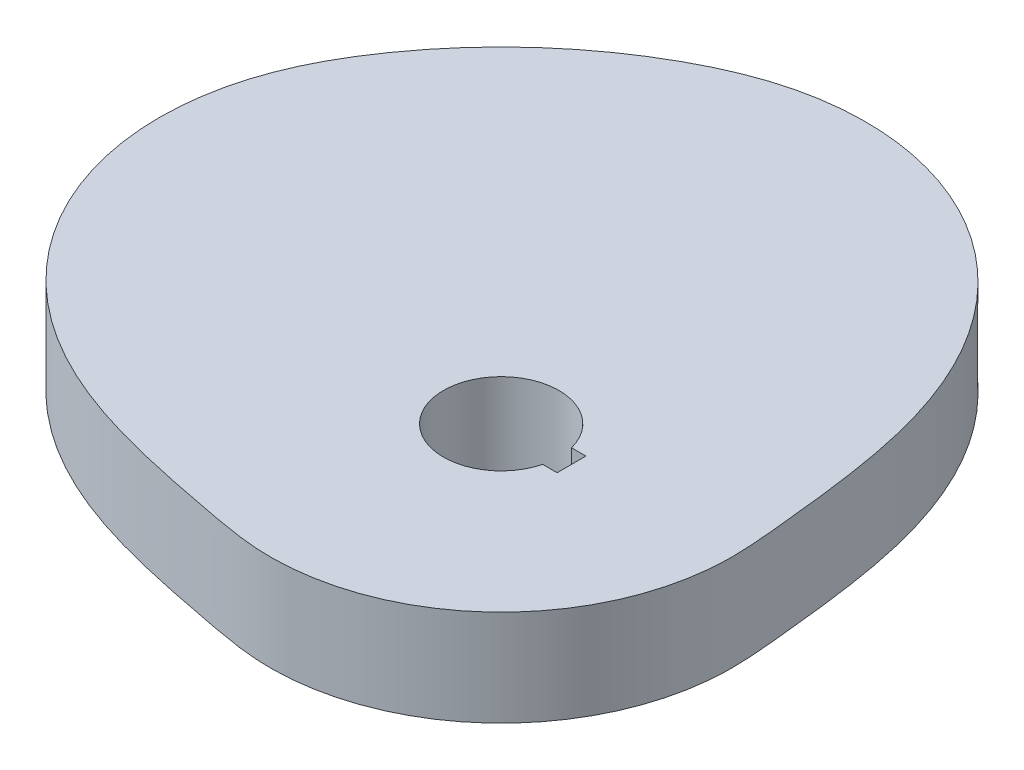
ISO-10303-21;
HEADER;
FILE_DESCRIPTION(('STEP AP214'),'2;1');
FILE_NAME('part.step','',(''),(''),'','','');
FILE_SCHEMA(('AUTOMOTIVE_DESIGN { 1 0 10303 214 1 1 1 1 }'));
ENDSEC;
DATA;
#1=APPLICATION_CONTEXT('core data for automotive mechanical design processes');
#2=APPLICATION_PROTOCOL_DEFINITION('international standard','automotive_design',2000,#1);
#3=PRODUCT_CONTEXT('',#1,'mechanical');
#4=PRODUCT('Part','Part','',(#3));
#5=PRODUCT_RELATED_PRODUCT_CATEGORY('part','',(#4));
#6=PRODUCT_DEFINITION_FORMATION('','',#4);
#7=PRODUCT_DEFINITION_CONTEXT('part definition',#1,'design');
#8=PRODUCT_DEFINITION('design','',#6,#7);
#9=PRODUCT_DEFINITION_SHAPE('','',#8);
#10=(LENGTH_UNIT() NAMED_UNIT(*) SI_UNIT(.MILLI.,.METRE.));
#11=(NAMED_UNIT(*) PLANE_ANGLE_UNIT() SI_UNIT($,.RADIAN.));
#12=(NAMED_UNIT(*) SI_UNIT($,.STERADIAN.) SOLID_ANGLE_UNIT());
#13=UNCERTAINTY_MEASURE_WITH_UNIT(LENGTH_MEASURE(1.E-05),#10,'distance_accuracy_value','');
#14=(GEOMETRIC_REPRESENTATION_CONTEXT(3) GLOBAL_UNCERTAINTY_ASSIGNED_CONTEXT((#13)) GLOBAL_UNIT_ASSIGNED_CONTEXT((#10,
#11,#12)) REPRESENTATION_CONTEXT('',''));
#15=CARTESIAN_POINT('',(0.,0.,0.));
#16=DIRECTION('',(0.,0.,1.));
#17=DIRECTION('',(1.,0.,0.));
#18=AXIS2_PLACEMENT_3D('',#15,#16,#17);
#19=CARTESIAN_POINT('',(0.,-31.75,0.));
#20=DIRECTION('',(0.,1.,0.));
#21=DIRECTION('',(0.,0.,1.));
#22=AXIS2_PLACEMENT_3D('',#19,#20,#21);
#23=PLANE('',#22);
#24=DIRECTION('',(0.,0.,-1.));
#25=VECTOR('',#24,1.);
#26=CARTESIAN_POINT('',(23.2338150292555,-31.75,4.7625));
#27=LINE('',#26,#25);
#28=CARTESIAN_POINT('',(23.2338150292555,-31.75,4.7625));
#29=VERTEX_POINT('',#28);
#30=CARTESIAN_POINT('',(23.2338150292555,-31.75,-4.7625));
#31=VERTEX_POINT('',#30);
#32=EDGE_CURVE('E85',#29,#31,#27,.T.);
#33=ORIENTED_EDGE('',*,*,#32,.T.);
#34=DIRECTION('',(-1.,0.,0.));
#35=VECTOR('',#34,1.);
#36=CARTESIAN_POINT('',(18.4713150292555,-31.75,-4.7625));
#37=LINE('',#36,#35);
#38=CARTESIAN_POINT('',(18.4713150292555,-31.75,-4.7625));
#39=VERTEX_POINT('',#38);
#40=EDGE_CURVE('E88',#31,#39,#37,.T.);
#41=ORIENTED_EDGE('',*,*,#40,.T.);
#42=CARTESIAN_POINT('',(0.,-31.75,0.));
#43=DIRECTION('',(0.,1.,0.));
#44=DIRECTION('',(0.,0.,1.));
#45=AXIS2_PLACEMENT_3D('',#42,#43,#44);
#46=CIRCLE('',#45,19.0754);
#47=CARTESIAN_POINT('',(18.4713150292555,-31.75,4.7625));
#48=VERTEX_POINT('',#47);
#49=EDGE_CURVE('E11',#39,#48,#46,.T.);
#50=ORIENTED_EDGE('',*,*,#49,.T.);
#51=DIRECTION('',(1.,0.,0.));
#52=VECTOR('',#51,1.);
#53=CARTESIAN_POINT('',(18.4713150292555,-31.75,4.7625));
#54=LINE('',#53,#52);
#55=EDGE_CURVE('E46',#48,#29,#54,.T.);
#56=ORIENTED_EDGE('',*,*,#55,.T.);
#57=EDGE_LOOP('',(#33,#41,#50,#56));
#58=FACE_BOUND('',#57,.T.);
#59=CARTESIAN_POINT('',(76.2,-31.75,0.));
#60=CARTESIAN_POINT('',(76.1999965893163,-31.75,-0.496360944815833));
#61=CARTESIAN_POINT('',(76.1905665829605,-31.75,-1.45933422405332));
#62=CARTESIAN_POINT('',(76.1529417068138,-31.75,-2.90276477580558));
#63=CARTESIAN_POINT('',(76.0954079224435,-31.75,-4.34402126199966));
#64=CARTESIAN_POINT('',(76.0181702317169,-31.75,-5.82607722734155));
#65=CARTESIAN_POINT('',(75.9227569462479,-31.75,-7.34731018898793));
#66=CARTESIAN_POINT('',(75.8108401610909,-31.75,-8.90576203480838));
#67=CARTESIAN_POINT('',(75.6841844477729,-31.75,-10.4991451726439));
#68=CARTESIAN_POINT('',(75.5445928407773,-31.75,-12.1248501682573));
#69=CARTESIAN_POINT('',(75.3938481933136,-31.75,-13.7799608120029));
#70=CARTESIAN_POINT('',(75.2336471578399,-31.75,-15.4612766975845));
#71=CARTESIAN_POINT('',(75.0655567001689,-31.75,-17.1653476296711));
#72=CARTESIAN_POINT('',(74.8908924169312,-31.75,-18.8885087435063));
#73=CARTESIAN_POINT('',(74.7109172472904,-31.75,-20.6269578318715));
#74=CARTESIAN_POINT('',(74.5240244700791,-31.75,-22.3941293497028));
#75=CARTESIAN_POINT('',(74.3365501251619,-31.75,-24.1517665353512));
#76=CARTESIAN_POINT('',(74.1430918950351,-31.75,-25.9143403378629));
#77=CARTESIAN_POINT('',(73.9477822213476,-31.75,-27.6635072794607));
#78=CARTESIAN_POINT('',(73.7454879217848,-31.75,-29.4338169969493));
#79=CARTESIAN_POINT('',(73.537802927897,-31.75,-31.2079323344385));
#80=CARTESIAN_POINT('',(73.3240682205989,-31.75,-32.9858871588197));
#81=CARTESIAN_POINT('',(73.1036341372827,-31.75,-34.7677420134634));
#82=CARTESIAN_POINT('',(72.8757780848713,-31.75,-36.55357300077));
#83=CARTESIAN_POINT('',(72.6397311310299,-31.75,-38.3434716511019));
#84=CARTESIAN_POINT('',(72.3946754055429,-31.75,-40.1375409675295));
#85=CARTESIAN_POINT('',(72.1397493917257,-31.75,-41.9358917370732));
#86=CARTESIAN_POINT('',(71.8740510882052,-31.75,-43.7386381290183));
#87=CARTESIAN_POINT('',(71.5966417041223,-31.75,-45.5458929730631));
#88=CARTESIAN_POINT('',(71.3065491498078,-31.75,-47.357762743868));
#89=CARTESIAN_POINT('',(71.0027715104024,-31.75,-49.1743423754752));
#90=CARTESIAN_POINT('',(70.6842804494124,-31.75,-50.9957099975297));
#91=CARTESIAN_POINT('',(70.3500245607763,-31.75,-52.8219216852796));
#92=CARTESIAN_POINT('',(69.9989326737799,-31.75,-54.6530063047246));
#93=CARTESIAN_POINT('',(69.6299171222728,-31.75,-56.4889605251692));
#94=CARTESIAN_POINT('',(69.2418769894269,-31.75,-58.3297440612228));
#95=CARTESIAN_POINT('',(68.8337013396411,-31.75,-60.1752751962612));
#96=CARTESIAN_POINT('',(68.4042724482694,-31.75,-62.0254266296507));
#97=CARTESIAN_POINT('',(67.9524690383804,-31.75,-63.880021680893));
#98=CARTESIAN_POINT('',(67.477169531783,-31.75,-65.7388308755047));
#99=CARTESIAN_POINT('',(66.9772553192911,-31.75,-67.6015689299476));
#100=CARTESIAN_POINT('',(66.4516140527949,-31.75,-69.4678921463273));
#101=CARTESIAN_POINT('',(65.8991429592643,-31.75,-71.3373962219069));
#102=CARTESIAN_POINT('',(65.3187521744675,-31.75,-73.2096144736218));
#103=CARTESIAN_POINT('',(64.7093680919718,-31.75,-75.0840164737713));
#104=CARTESIAN_POINT('',(64.0699367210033,-31.75,-76.9600070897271));
#105=CARTESIAN_POINT('',(63.39942704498,-31.75,-78.8369259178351));
#106=CARTESIAN_POINT('',(62.6968343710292,-31.75,-80.7140470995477));
#107=CARTESIAN_POINT('',(61.9611836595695,-31.75,-82.5905795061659));
#108=CARTESIAN_POINT('',(61.1915328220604,-31.75,-84.4656672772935));
#109=CARTESIAN_POINT('',(60.3869759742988,-31.75,-86.3383906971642));
#110=CARTESIAN_POINT('',(59.5466466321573,-31.75,-88.2077673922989));
#111=CARTESIAN_POINT('',(58.6697208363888,-31.75,-90.0727538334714));
#112=CARTESIAN_POINT('',(57.7554201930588,-31.75,-91.9322471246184));
#113=CARTESIAN_POINT('',(56.8030148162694,-31.75,-93.785087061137));
#114=CARTESIAN_POINT('',(55.8118261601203,-31.75,-95.6300584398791));
#115=CARTESIAN_POINT('',(54.7812297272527,-31.75,-97.4658936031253));
#116=CARTESIAN_POINT('',(53.7106576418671,-31.75,-99.2912751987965));
#117=CARTESIAN_POINT('',(52.5996010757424,-31.75,-101.104839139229));
#118=CARTESIAN_POINT('',(51.447612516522,-31.75,-102.905177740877));
#119=CARTESIAN_POINT('',(50.2543078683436,-31.75,-104.690843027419));
#120=CARTESIAN_POINT('',(49.019368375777,-31.75,-106.460350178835));
#121=CARTESIAN_POINT('',(47.7425423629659,-31.75,-108.212181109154));
#122=CARTESIAN_POINT('',(46.423646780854,-31.75,-109.944788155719));
#123=CARTESIAN_POINT('',(45.0625685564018,-31.75,-111.656597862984));
#124=CARTESIAN_POINT('',(43.6592657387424,-31.75,-113.346014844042));
#125=CARTESIAN_POINT('',(42.2137684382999,-31.75,-115.011425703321));
#126=CARTESIAN_POINT('',(40.7261795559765,-31.75,-116.65120300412));
#127=CARTESIAN_POINT('',(39.1966753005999,-31.75,-118.263709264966));
#128=CARTESIAN_POINT('',(37.625505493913,-31.75,-119.847300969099));
#129=CARTESIAN_POINT('',(36.0129936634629,-31.75,-121.400332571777));
#130=CARTESIAN_POINT('',(34.3595369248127,-31.75,-122.921160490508));
#131=CARTESIAN_POINT('',(32.6656056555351,-31.75,-124.408147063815));
#132=CARTESIAN_POINT('',(30.9317429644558,-31.75,-125.859664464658));
#133=CARTESIAN_POINT('',(29.1585639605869,-31.75,-127.274098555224));
#134=CARTESIAN_POINT('',(27.3467548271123,-31.75,-128.649852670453));
#135=CARTESIAN_POINT('',(25.4970717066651,-31.75,-129.985351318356));
#136=CARTESIAN_POINT('',(23.6103394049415,-31.75,-131.279043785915));
#137=CARTESIAN_POINT('',(21.687449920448,-31.75,-132.52940764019));
#138=CARTESIAN_POINT('',(19.7293608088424,-31.75,-133.734952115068));
#139=CARTESIAN_POINT('',(17.7370933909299,-31.75,-134.89422137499));
#140=CARTESIAN_POINT('',(15.7117308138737,-31.75,-136.005797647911));
#141=CARTESIAN_POINT('',(13.6544159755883,-31.75,-137.068304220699));
#142=CARTESIAN_POINT('',(11.566349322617,-31.75,-138.080408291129));
#143=CARTESIAN_POINT('',(9.44878653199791,-31.75,-139.04082367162));
#144=CARTESIAN_POINT('',(7.30303608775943,-31.75,-139.948313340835));
#145=CARTESIAN_POINT('',(5.13045676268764,-31.75,-140.801691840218));
#146=CARTESIAN_POINT('',(2.93245501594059,-31.75,-141.599827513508));
#147=CARTESIAN_POINT('',(0.710482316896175,-31.75,-142.341644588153));
#148=CARTESIAN_POINT('',(-1.53396759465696,-31.75,-143.026125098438));
#149=CARTESIAN_POINT('',(-3.79936150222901,-31.75,-143.652310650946));
#150=CARTESIAN_POINT('',(-6.08412955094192,-31.75,-144.219304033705));
#151=CARTESIAN_POINT('',(-8.38666812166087,-31.75,-144.726270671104));
#152=CARTESIAN_POINT('',(-10.7053427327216,-31.75,-145.172439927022));
#153=CARTESIAN_POINT('',(-13.0384909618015,-31.75,-145.557106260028));
#154=CARTESIAN_POINT('',(-15.3844253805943,-31.75,-145.879630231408));
#155=CARTESIAN_POINT('',(-17.7414364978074,-31.75,-146.139439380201));
#156=CARTESIAN_POINT('',(-20.1077956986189,-31.75,-146.336028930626));
#157=CARTESIAN_POINT('',(-22.4817581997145,-31.75,-146.468962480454));
#158=CARTESIAN_POINT('',(-24.8615659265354,-31.75,-146.537872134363));
#159=CARTESIAN_POINT('',(-27.2454506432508,-31.75,-146.542460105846));
#160=CARTESIAN_POINT('',(-29.6316360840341,-31.75,-146.482494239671));
#161=CARTESIAN_POINT('',(-32.018343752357,-31.75,-146.357825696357));
#162=CARTESIAN_POINT('',(-34.4037849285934,-31.75,-146.168323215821));
#163=CARTESIAN_POINT('',(-36.7862041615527,-31.75,-145.914118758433));
#164=CARTESIAN_POINT('',(-39.1740571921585,-31.75,-145.593300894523));
#165=CARTESIAN_POINT('',(-41.5454018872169,-31.75,-145.21046226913));
#166=CARTESIAN_POINT('',(-43.9090898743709,-31.75,-144.761208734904));
#167=CARTESIAN_POINT('',(-46.2552825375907,-31.75,-144.250356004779));
#168=CARTESIAN_POINT('',(-48.6046101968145,-31.75,-143.672427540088));
#169=CARTESIAN_POINT('',(-50.9475237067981,-31.75,-143.029888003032));
#170=CARTESIAN_POINT('',(-53.2845908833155,-31.75,-142.322888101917));
#171=CARTESIAN_POINT('',(-55.6163734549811,-31.75,-141.551760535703));
#172=CARTESIAN_POINT('',(-57.9434051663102,-31.75,-140.716956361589));
#173=CARTESIAN_POINT('',(-60.2661889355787,-31.75,-139.819075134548));
#174=CARTESIAN_POINT('',(-62.5851919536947,-31.75,-138.858868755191));
#175=CARTESIAN_POINT('',(-64.9008441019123,-31.75,-137.837250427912));
#176=CARTESIAN_POINT('',(-67.2135372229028,-31.75,-136.7552993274));
#177=CARTESIAN_POINT('',(-69.523626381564,-31.75,-135.614262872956));
#178=CARTESIAN_POINT('',(-71.8314269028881,-31.75,-134.415555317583));
#179=CARTESIAN_POINT('',(-74.0593719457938,-31.75,-133.203121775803));
#180=CARTESIAN_POINT('',(-76.3602393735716,-31.75,-131.898553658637));
#181=CARTESIAN_POINT('',(-78.6481629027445,-31.75,-130.548188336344));
#182=CARTESIAN_POINT('',(-80.9892541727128,-31.75,-129.10793518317));
#183=CARTESIAN_POINT('',(-83.2301645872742,-31.75,-127.674814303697));
#184=CARTESIAN_POINT('',(-85.4457206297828,-31.75,-126.202802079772));
#185=CARTESIAN_POINT('',(-87.6352495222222,-31.75,-124.692347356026));
#186=CARTESIAN_POINT('',(-89.7980837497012,-31.75,-123.143910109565));
#187=CARTESIAN_POINT('',(-91.9335646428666,-31.75,-121.557962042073));
#188=CARTESIAN_POINT('',(-94.0410416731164,-31.75,-119.934986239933));
#189=CARTESIAN_POINT('',(-96.1198728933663,-31.75,-118.275477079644));
#190=CARTESIAN_POINT('',(-98.1694250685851,-31.75,-116.579940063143));
#191=CARTESIAN_POINT('',(-100.189073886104,-31.75,-114.848891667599));
#192=CARTESIAN_POINT('',(-102.17820414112,-31.75,-113.082859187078));
#193=CARTESIAN_POINT('',(-104.136209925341,-31.75,-111.282380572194));
#194=CARTESIAN_POINT('',(-106.062494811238,-31.75,-109.448004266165));
#195=CARTESIAN_POINT('',(-107.956472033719,-31.75,-107.580289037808));
#196=CARTESIAN_POINT('',(-109.817564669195,-31.75,-105.67980381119));
#197=CARTESIAN_POINT('',(-111.645205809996,-31.75,-103.747127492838));
#198=CARTESIAN_POINT('',(-113.438838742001,-31.75,-101.782848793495));
#199=CARTESIAN_POINT('',(-115.197917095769,-31.75,-99.7875660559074));
#200=CARTESIAN_POINT('',(-116.921905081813,-31.75,-97.7618870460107));
#201=CARTESIAN_POINT('',(-118.610277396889,-31.75,-95.7064288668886));
#202=CARTESIAN_POINT('',(-120.262520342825,-31.75,-93.6218174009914));
#203=CARTESIAN_POINT('',(-121.878128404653,-31.75,-91.5086884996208));
#204=CARTESIAN_POINT('',(-123.404002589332,-31.75,-89.4390479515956));
#205=CARTESIAN_POINT('',(-124.943852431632,-31.75,-87.2762496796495));
#206=CARTESIAN_POINT('',(-126.438386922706,-31.75,-85.0979299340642));
#207=CARTESIAN_POINT('',(-127.927106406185,-31.75,-82.8348303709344));
#208=CARTESIAN_POINT('',(-129.311059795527,-31.75,-80.6388575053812));
#209=CARTESIAN_POINT('',(-130.6374699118,-31.75,-78.4354942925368));
#210=CARTESIAN_POINT('',(-131.904990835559,-31.75,-76.22429627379));
#211=CARTESIAN_POINT('',(-133.112444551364,-31.75,-74.0047972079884));
#212=CARTESIAN_POINT('',(-134.258824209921,-31.75,-71.7765078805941));
#213=CARTESIAN_POINT('',(-135.343291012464,-31.75,-69.5389159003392));
#214=CARTESIAN_POINT('',(-136.365167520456,-31.75,-67.2914854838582));
#215=CARTESIAN_POINT('',(-137.323934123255,-31.75,-65.0336602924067));
#216=CARTESIAN_POINT('',(-138.219202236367,-31.75,-62.764862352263));
#217=CARTESIAN_POINT('',(-139.050766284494,-31.75,-60.4845151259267));
#218=CARTESIAN_POINT('',(-139.818359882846,-31.75,-58.1919885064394));
#219=CARTESIAN_POINT('',(-140.519477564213,-31.75,-55.8967715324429));
#220=CARTESIAN_POINT('',(-141.158656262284,-31.75,-53.5781702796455));
#221=CARTESIAN_POINT('',(-141.735562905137,-31.75,-51.2471301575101));
#222=CARTESIAN_POINT('',(-142.249983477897,-31.75,-48.8939949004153));
#223=CARTESIAN_POINT('',(-142.698128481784,-31.75,-46.5409488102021));
#224=CARTESIAN_POINT('',(-143.081903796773,-31.75,-44.179570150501));
#225=CARTESIAN_POINT('',(-143.401222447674,-31.75,-41.8116452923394));
#226=CARTESIAN_POINT('',(-143.656023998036,-31.75,-39.4389560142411));
#227=CARTESIAN_POINT('',(-143.846328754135,-31.75,-37.063290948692));
#228=CARTESIAN_POINT('',(-143.972223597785,-31.75,-34.6864388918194));
#229=CARTESIAN_POINT('',(-144.033865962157,-31.75,-32.310186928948));
#230=CARTESIAN_POINT('',(-144.031482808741,-31.75,-29.9363172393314));
#231=CARTESIAN_POINT('',(-143.96537078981,-31.75,-27.5666042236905));
#232=CARTESIAN_POINT('',(-143.835895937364,-31.75,-25.2028115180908));
#233=CARTESIAN_POINT('',(-143.643493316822,-31.75,-22.8466890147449));
#234=CARTESIAN_POINT('',(-143.388666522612,-31.75,-20.4999698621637));
#235=CARTESIAN_POINT('',(-143.071987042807,-31.75,-18.1643674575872));
#236=CARTESIAN_POINT('',(-142.69409347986,-31.75,-15.8415724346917));
#237=CARTESIAN_POINT('',(-142.255690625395,-31.75,-13.5332496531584));
#238=CARTESIAN_POINT('',(-141.757548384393,-31.75,-11.2410351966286));
#239=CARTESIAN_POINT('',(-141.200500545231,-31.75,-8.96653338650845));
#240=CARTESIAN_POINT('',(-140.585443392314,-31.75,-6.71131381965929));
#241=CARTESIAN_POINT('',(-139.913334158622,-31.75,-4.47690843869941));
#242=CARTESIAN_POINT('',(-139.185189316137,-31.75,-2.26480864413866));
#243=CARTESIAN_POINT('',(-138.402082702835,-31.75,-0.0764624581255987));
#244=CARTESIAN_POINT('',(-137.565143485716,-31.75,2.08672825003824));
#245=CARTESIAN_POINT('',(-136.675553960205,-31.75,4.22341046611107));
#246=CARTESIAN_POINT('',(-135.734547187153,-31.75,6.33228265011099));
#247=CARTESIAN_POINT('',(-134.743404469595,-31.75,8.4120972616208));
#248=CARTESIAN_POINT('',(-133.703452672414,-31.75,10.4616631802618));
#249=CARTESIAN_POINT('',(-132.616061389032,-31.75,12.4798480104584));
#250=CARTESIAN_POINT('',(-131.482639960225,-31.75,14.4655802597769));
#251=CARTESIAN_POINT('',(-130.304634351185,-31.75,16.4178513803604));
#252=CARTESIAN_POINT('',(-129.08352389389,-31.75,18.3357176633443));
#253=CARTESIAN_POINT('',(-127.820817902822,-31.75,20.2183019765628));
#254=CARTESIAN_POINT('',(-126.518052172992,-31.75,22.0647953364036));
#255=CARTESIAN_POINT('',(-125.176785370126,-31.75,23.8744583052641));
#256=CARTESIAN_POINT('',(-123.798595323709,-31.75,25.6466222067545));
#257=CARTESIAN_POINT('',(-122.385075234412,-31.75,27.3806901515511));
#258=CARTESIAN_POINT('',(-120.937829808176,-31.75,29.0761378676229));
#259=CARTESIAN_POINT('',(-119.458471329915,-31.75,30.7325143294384));
#260=CARTESIAN_POINT('',(-117.948615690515,-31.75,32.3494421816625));
#261=CARTESIAN_POINT('',(-116.409878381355,-31.75,33.9266179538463));
#262=CARTESIAN_POINT('',(-114.843870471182,-31.75,35.4638120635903));
#263=CARTESIAN_POINT('',(-113.252194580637,-31.75,36.9608686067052));
#264=CARTESIAN_POINT('',(-111.636440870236,-31.75,38.4177049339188));
#265=CARTESIAN_POINT('',(-109.998183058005,-31.75,39.8343110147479));
#266=CARTESIAN_POINT('',(-108.338974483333,-31.75,41.2107485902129));
#267=CARTESIAN_POINT('',(-106.660344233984,-31.75,42.5471501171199));
#268=CARTESIAN_POINT('',(-104.963793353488,-31.75,43.8437175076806));
#269=CARTESIAN_POINT('',(-103.250791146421,-31.75,45.1007206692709));
#270=CARTESIAN_POINT('',(-101.522771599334,-31.75,46.318495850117));
#271=CARTESIAN_POINT('',(-99.7811299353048,-31.75,47.4974437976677));
#272=CARTESIAN_POINT('',(-98.0272193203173,-31.75,48.6380277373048));
#273=CARTESIAN_POINT('',(-96.2623477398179,-31.75,49.7407711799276));
#274=CARTESIAN_POINT('',(-94.487775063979,-31.75,50.8062555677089));
#275=CARTESIAN_POINT('',(-92.7047103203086,-31.75,51.8351177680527));
#276=CARTESIAN_POINT('',(-90.9143091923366,-31.75,52.8280474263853));
#277=CARTESIAN_POINT('',(-89.117671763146,-31.75,53.7857841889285));
#278=CARTESIAN_POINT('',(-87.3158405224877,-31.75,54.7091148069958));
#279=CARTESIAN_POINT('',(-85.5097986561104,-31.75,55.5988701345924));
#280=CARTESIAN_POINT('',(-83.7004686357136,-31.75,56.4559220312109));
#281=CARTESIAN_POINT('',(-81.8887111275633,-31.75,57.2811801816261));
#282=CARTESIAN_POINT('',(-80.0753242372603,-31.75,58.0755888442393));
#283=CARTESIAN_POINT('',(-78.261043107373,-31.75,58.8401235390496));
#284=CARTESIAN_POINT('',(-76.4465398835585,-31.75,59.5757876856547));
#285=CARTESIAN_POINT('',(-74.6324240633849,-31.75,60.2836092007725));
#286=CARTESIAN_POINT('',(-72.8192432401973,-31.75,60.9646370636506));
#287=CARTESIAN_POINT('',(-71.0074842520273,-31.75,61.6199378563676));
#288=CARTESIAN_POINT('',(-69.1975747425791,-31.75,62.2505922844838));
#289=CARTESIAN_POINT('',(-67.389885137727,-31.75,62.8576916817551));
#290=CARTESIAN_POINT('',(-65.5847310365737,-31.75,63.4423345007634));
#291=CARTESIAN_POINT('',(-63.782376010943,-31.75,64.005622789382));
#292=CARTESIAN_POINT('',(-61.9830348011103,-31.75,64.5486586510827));
#293=CARTESIAN_POINT('',(-60.1868768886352,-31.75,65.0725406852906));
#294=CARTESIAN_POINT('',(-58.3940304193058,-31.75,65.5783604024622));
#295=CARTESIAN_POINT('',(-56.6045864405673,-31.75,66.0671986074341));
#296=CARTESIAN_POINT('',(-54.8186034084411,-31.75,66.5401217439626));
#297=CARTESIAN_POINT('',(-53.0361119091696,-31.75,66.9981781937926));
#298=CARTESIAN_POINT('',(-51.2571195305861,-31.75,67.4423945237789));
#299=CARTESIAN_POINT('',(-49.4816158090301,-31.75,67.8737716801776));
#300=CARTESIAN_POINT('',(-47.7095771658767,-31.75,68.2932811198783));
#301=CARTESIAN_POINT('',(-45.9409717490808,-31.75,68.7018609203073));
#302=CARTESIAN_POINT('',(-44.175764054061,-31.75,69.1004117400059));
#303=CARTESIAN_POINT('',(-42.4139193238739,-31.75,69.4897931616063));
#304=CARTESIAN_POINT('',(-40.6554072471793,-31.75,69.870818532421));
#305=CARTESIAN_POINT('',(-38.900206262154,-31.75,70.2442554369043));
#306=CARTESIAN_POINT('',(-37.1483031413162,-31.75,70.6108054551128));
#307=CARTESIAN_POINT('',(-35.3997072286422,-31.75,70.9711613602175));
#308=CARTESIAN_POINT('',(-33.6544069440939,-31.75,71.3257770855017));
#309=CARTESIAN_POINT('',(-31.9296585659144,-31.75,71.6722671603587));
#310=CARTESIAN_POINT('',(-30.1911408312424,-31.75,72.0160602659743));
#311=CARTESIAN_POINT('',(-28.4580639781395,-31.75,72.3567085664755));
#312=CARTESIAN_POINT('',(-26.7157114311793,-31.75,72.6954330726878));
#313=CARTESIAN_POINT('',(-25.0022307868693,-31.75,73.0251047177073));
#314=CARTESIAN_POINT('',(-23.3042425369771,-31.75,73.3477450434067));
#315=CARTESIAN_POINT('',(-21.6254278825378,-31.75,73.6618932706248));
#316=CARTESIAN_POINT('',(-19.9692720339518,-31.75,73.9658313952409));
#317=CARTESIAN_POINT('',(-18.3390280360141,-31.75,74.257681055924));
#318=CARTESIAN_POINT('',(-16.7376794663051,-31.75,74.5354532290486));
#319=CARTESIAN_POINT('',(-15.1679158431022,-31.75,74.7971146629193));
#320=CARTESIAN_POINT('',(-13.6321165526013,-31.75,75.0406501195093));
#321=CARTESIAN_POINT('',(-12.132342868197,-31.75,75.2641224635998));
#322=CARTESIAN_POINT('',(-10.6703349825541,-31.75,75.4657258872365));
#323=CARTESIAN_POINT('',(-9.24751412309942,-31.75,75.6438344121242));
#324=CARTESIAN_POINT('',(-7.90909022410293,-31.75,75.7921426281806));
#325=CARTESIAN_POINT('',(-6.55906277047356,-31.75,75.921136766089));
#326=CARTESIAN_POINT('',(-5.22727989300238,-31.75,76.0247707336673));
#327=CARTESIAN_POINT('',(-3.85537830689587,-31.75,76.1062793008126));
#328=CARTESIAN_POINT('',(-2.52655271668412,-31.75,76.1619729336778));
#329=CARTESIAN_POINT('',(-1.1969583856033,-31.75,76.1944676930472));
#330=CARTESIAN_POINT('',(0.13300078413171,-31.75,76.2037526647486));
#331=CARTESIAN_POINT('',(1.46291937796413,-31.75,76.1898252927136));
#332=CARTESIAN_POINT('',(2.7923923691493,-31.75,76.1526897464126));
#333=CARTESIAN_POINT('',(4.12101476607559,-31.75,76.0923573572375));
#334=CARTESIAN_POINT('',(5.44838186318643,-31.75,76.0088464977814));
#335=CARTESIAN_POINT('',(6.77408933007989,-31.75,75.9021826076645));
#336=CARTESIAN_POINT('',(8.0977333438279,-31.75,75.7723981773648));
#337=CARTESIAN_POINT('',(9.41891070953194,-31.75,75.6195327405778));
#338=CARTESIAN_POINT('',(10.7372189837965,-31.75,75.4436328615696));
#339=CARTESIAN_POINT('',(12.0522565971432,-31.75,75.2447521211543));
#340=CARTESIAN_POINT('',(13.363622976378,-31.75,75.0229511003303));
#341=CARTESIAN_POINT('',(14.670918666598,-31.75,74.7782973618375));
#342=CARTESIAN_POINT('',(15.9737454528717,-31.75,74.5108654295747));
#343=CARTESIAN_POINT('',(17.2717064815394,-31.75,74.2207367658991));
#344=CARTESIAN_POINT('',(18.564406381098,-31.75,73.9079997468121));
#345=CARTESIAN_POINT('',(19.8514513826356,-31.75,73.5727496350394));
#346=CARTESIAN_POINT('',(21.1324494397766,-31.75,73.2150885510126));
#347=CARTESIAN_POINT('',(22.4070103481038,-31.75,72.8351254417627));
#348=CARTESIAN_POINT('',(23.6747458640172,-31.75,72.4329760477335));
#349=CARTESIAN_POINT('',(24.9352698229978,-31.75,72.0087628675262));
#350=CARTESIAN_POINT('',(26.1881982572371,-31.75,71.562615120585));
#351=CARTESIAN_POINT('',(27.4331495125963,-31.75,71.0946687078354));
#352=CARTESIAN_POINT('',(28.6697443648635,-31.75,70.6050661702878));
#353=CARTESIAN_POINT('',(29.8976061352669,-31.75,70.0939566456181));
#354=CARTESIAN_POINT('',(31.1163608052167,-31.75,69.5614958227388));
#355=CARTESIAN_POINT('',(32.3256371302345,-31.75,69.0078458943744));
#356=CARTESIAN_POINT('',(33.5250667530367,-31.75,68.4331755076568));
#357=CARTESIAN_POINT('',(34.7142843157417,-31.75,67.8376597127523));
#358=CARTESIAN_POINT('',(35.8929275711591,-31.75,67.2214799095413));
#359=CARTESIAN_POINT('',(37.0606374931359,-31.75,66.5848237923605));
#360=CARTESIAN_POINT('',(38.2170583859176,-31.75,65.9278852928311));
#361=CARTESIAN_POINT('',(39.3618379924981,-31.75,65.2508645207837));
#362=CARTESIAN_POINT('',(40.4946276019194,-31.75,64.5539677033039));
#363=CARTESIAN_POINT('',(41.6150821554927,-31.75,63.8374071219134));
#364=CARTESIAN_POINT('',(42.7228603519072,-31.75,63.1014010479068));
#365=CARTESIAN_POINT('',(43.8176247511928,-31.75,62.3461736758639));
#366=CARTESIAN_POINT('',(44.8990418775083,-31.75,61.5719550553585));
#367=CARTESIAN_POINT('',(45.9667823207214,-31.75,60.7789810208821));
#368=CARTESIAN_POINT('',(47.0205208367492,-31.75,59.9674931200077));
#369=CARTESIAN_POINT('',(48.0599364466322,-31.75,59.1377385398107));
#370=CARTESIAN_POINT('',(49.0847125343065,-31.75,58.2899700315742));
#371=CARTESIAN_POINT('',(50.0945369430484,-31.75,57.4244458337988));
#372=CARTESIAN_POINT('',(51.089102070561,-31.75,56.541429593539));
#373=CARTESIAN_POINT('',(52.0681049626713,-31.75,55.6411902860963));
#374=CARTESIAN_POINT('',(53.0312474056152,-31.75,54.7240021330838));
#375=CARTESIAN_POINT('',(53.9782360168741,-31.75,53.7901445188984));
#376=CARTESIAN_POINT('',(54.9087823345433,-31.75,52.8399019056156));
#377=CARTESIAN_POINT('',(55.8226029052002,-31.75,51.8735637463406));
#378=CARTESIAN_POINT('',(56.7194193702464,-31.75,50.8914243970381));
#379=CARTESIAN_POINT('',(57.5989585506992,-31.75,49.8937830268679));
#380=CARTESIAN_POINT('',(58.4609525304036,-31.75,48.8809435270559));
#381=CARTESIAN_POINT('',(59.3051387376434,-31.75,47.8532144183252));
#382=CARTESIAN_POINT('',(60.1312600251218,-31.75,46.8109087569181));
#383=CARTESIAN_POINT('',(60.939064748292,-31.75,45.7543440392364));
#384=CARTESIAN_POINT('',(61.7283068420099,-31.75,44.6838421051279));
#385=CARTESIAN_POINT('',(62.498745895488,-31.75,43.5997290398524));
#386=CARTESIAN_POINT('',(63.2501472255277,-31.75,42.502335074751));
#387=CARTESIAN_POINT('',(63.9822819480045,-31.75,41.3919944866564));
#388=CARTESIAN_POINT('',(64.6949270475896,-31.75,40.269045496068));
#389=CARTESIAN_POINT('',(65.3878654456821,-31.75,39.1338301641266));
#390=CARTESIAN_POINT('',(66.0608860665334,-31.75,37.9866942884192));
#391=CARTESIAN_POINT('',(66.7137839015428,-31.75,36.8279872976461));
#392=CARTESIAN_POINT('',(67.3463600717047,-31.75,35.6580621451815));
#393=CARTESIAN_POINT('',(67.95842188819,-31.75,34.4772752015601));
#394=CARTESIAN_POINT('',(68.54978291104,-31.75,33.2859861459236));
#395=CARTESIAN_POINT('',(69.1202630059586,-31.75,32.0845578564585));
#396=CARTESIAN_POINT('',(69.6696883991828,-31.75,30.8733562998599));
#397=CARTESIAN_POINT('',(70.197891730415,-31.75,29.6527504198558));
#398=CARTESIAN_POINT('',(70.7047121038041,-31.75,28.4231120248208));
#399=CARTESIAN_POINT('',(71.1899951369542,-31.75,27.1848156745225));
#400=CARTESIAN_POINT('',(71.6535930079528,-31.75,25.9382385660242));
#401=CARTESIAN_POINT('',(72.0953645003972,-31.75,24.6837604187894));
#402=CARTESIAN_POINT('',(72.5151750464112,-31.75,23.4217633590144));
#403=CARTESIAN_POINT('',(72.912896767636,-31.75,22.1526318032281));
#404=CARTESIAN_POINT('',(73.2884085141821,-31.75,20.8767523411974));
#405=CARTESIAN_POINT('',(73.641595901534,-31.75,19.5945136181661));
#406=CARTESIAN_POINT('',(73.9723513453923,-31.75,18.3063062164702));
#407=CARTESIAN_POINT('',(74.2805740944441,-31.75,17.0125225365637));
#408=CARTESIAN_POINT('',(74.5661702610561,-31.75,15.713556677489));
#409=CARTESIAN_POINT('',(74.8290528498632,-31.75,14.4098043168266));
#410=CARTESIAN_POINT('',(75.0691417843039,-31.75,13.1016625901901));
#411=CARTESIAN_POINT('',(75.2863639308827,-31.75,11.7895299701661));
#412=CARTESIAN_POINT('',(75.480653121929,-31.75,10.4738061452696));
#413=CARTESIAN_POINT('',(75.6519501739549,-31.75,9.15489189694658));
#414=CARTESIAN_POINT('',(75.8002029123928,-31.75,7.83318898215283));
#415=CARTESIAN_POINT('',(75.925366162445,-31.75,6.50909999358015));
#416=CARTESIAN_POINT('',(76.027401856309,-31.75,5.18302830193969));
#417=CARTESIAN_POINT('',(76.1062786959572,-31.75,3.8553776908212));
#418=CARTESIAN_POINT('',(76.1619734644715,-31.75,2.52655313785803));
#419=CARTESIAN_POINT('',(76.1933831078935,-31.75,1.24127621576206));
#420=CARTESIAN_POINT('',(76.2000027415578,-31.75,0.39898224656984));
#421=CARTESIAN_POINT('',(76.2,-31.75,0.));
#422=B_SPLINE_CURVE_WITH_KNOTS('',3,(#59,#60,#61,#62,#63,#64,#65,#66,#67,#68,#69,#70,#71,#72,
#73,#74,#75,#76,#77,#78,#79,#80,#81,#82,#83,#84,#85,#86,#87,#88,#89,#90,#91,#92,#93,#94,#95,#96,
#97,#98,#99,#100,#101,#102,#103,#104,#105,#106,#107,#108,#109,#110,#111,#112,#113,#114,#115,
#116,#117,#118,#119,#120,#121,#122,#123,#124,#125,#126,#127,#128,#129,#130,#131,#132,#133,#134,
#135,#136,#137,#138,#139,#140,#141,#142,#143,#144,#145,#146,#147,#148,#149,#150,#151,#152,#153,
#154,#155,#156,#157,#158,#159,#160,#161,#162,#163,#164,#165,#166,#167,#168,#169,#170,#171,#172,
#173,#174,#175,#176,#177,#178,#179,#180,#181,#182,#183,#184,#185,#186,#187,#188,#189,#190,#191,
#192,#193,#194,#195,#196,#197,#198,#199,#200,#201,#202,#203,#204,#205,#206,#207,#208,#209,#210,
#211,#212,#213,#214,#215,#216,#217,#218,#219,#220,#221,#222,#223,#224,#225,#226,#227,#228,#229,
#230,#231,#232,#233,#234,#235,#236,#237,#238,#239,#240,#241,#242,#243,#244,#245,#246,#247,#248,
#249,#250,#251,#252,#253,#254,#255,#256,#257,#258,#259,#260,#261,#262,#263,#264,#265,#266,#267,
#268,#269,#270,#271,#272,#273,#274,#275,#276,#277,#278,#279,#280,#281,#282,#283,#284,#285,#286,
#287,#288,#289,#290,#291,#292,#293,#294,#295,#296,#297,#298,#299,#300,#301,#302,#303,#304,#305,
#306,#307,#308,#309,#310,#311,#312,#313,#314,#315,#316,#317,#318,#319,#320,#321,#322,#323,#324,
#325,#326,#327,#328,#329,#330,#331,#332,#333,#334,#335,#336,#337,#338,#339,#340,#341,#342,#343,
#344,#345,#346,#347,#348,#349,#350,#351,#352,#353,#354,#355,#356,#357,#358,#359,#360,#361,#362,
#363,#364,#365,#366,#367,#368,#369,#370,#371,#372,#373,#374,#375,#376,#377,#378,#379,#380,#381,
#382,#383,#384,#385,#386,#387,#388,#389,#390,#391,#392,#393,#394,#395,#396,#397,#398,#399,#400,
#401,#402,#403,#404,#405,#406,#407,#408,#409,#410,#411,#412,#413,#414,#415,#416,#417,#418,#419,
#420,#421),.UNSPECIFIED.,.T.,.F.,(4,1,1,1,1,1,1,1,1,1,1,1,1,1,1,1,1,1,1,1,1,1,1,1,1,1,1,1,1,1,1,
1,1,1,1,1,1,1,1,1,1,1,1,1,1,1,1,1,1,1,1,1,1,1,1,1,1,1,1,1,1,1,1,1,1,1,1,1,1,1,1,1,1,1,1,1,1,1,1,
1,1,1,1,1,1,1,1,1,1,1,1,1,1,1,1,1,1,1,1,1,1,1,1,1,1,1,1,1,1,1,1,1,1,1,1,1,1,1,1,1,1,1,1,1,1,1,1,
1,1,1,1,1,1,1,1,1,1,1,1,1,1,1,1,1,1,1,1,1,1,1,1,1,1,1,1,1,1,1,1,1,1,1,1,1,1,1,1,1,1,1,1,1,1,1,1,
1,1,1,1,1,1,1,1,1,1,1,1,1,1,1,1,1,1,1,1,1,1,1,1,1,1,1,1,1,1,1,1,1,1,1,1,1,1,1,1,1,1,1,1,1,1,1,1,
1,1,1,1,1,1,1,1,1,1,1,1,1,1,1,1,1,1,1,1,1,1,1,1,1,1,1,1,1,1,1,1,1,1,1,1,1,1,1,1,1,1,1,1,1,1,1,1,
1,1,1,1,1,1,1,1,1,1,1,1,1,1,1,1,1,1,1,1,1,1,1,1,1,1,1,1,1,1,1,1,1,1,1,1,1,1,1,1,1,1,1,1,1,1,1,1,
1,1,1,1,1,1,1,1,1,1,1,1,1,1,1,1,1,1,1,1,1,1,1,1,1,1,1,1,1,1,1,1,1,1,1,1,1,1,1,1,1,4),(0.,
0.00213291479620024,0.00413799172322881,0.00620453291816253,0.00833096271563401,
0.0105151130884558,0.0127542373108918,0.0150450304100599,0.017383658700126,0.0197658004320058,
0.022186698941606,0.0246412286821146,0.027123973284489,0.0296293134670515,0.0321515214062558,
0.0347601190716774,0.0372249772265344,0.0397710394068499,0.0423232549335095,0.0448817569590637,
0.0474467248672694,0.0500183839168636,0.0525970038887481,0.0551828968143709,0.05777641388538,
0.0603779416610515,0.0629878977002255,0.0656067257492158,0.0682348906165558,0.0708728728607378,
0.0735211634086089,0.0761802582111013,0.0788506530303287,0.0815328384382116,0.0842272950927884,
0.0869344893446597,0.0896548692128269,0.0923888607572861,0.0951368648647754,0.0978992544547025,
0.100676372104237,0.10346852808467,0.106275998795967,0.109099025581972,0.111937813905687,
0.114792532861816,0.117663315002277,0.120550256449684,0.123453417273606,0.126372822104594,
0.129308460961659,0.132260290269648,0.135228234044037,0.138212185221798,0.141212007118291,
0.144227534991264,0.14725857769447,0.150304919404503,0.153366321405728,0.156442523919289,
0.159533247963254,0.162638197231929,0.165757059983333,0.168889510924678,0.172035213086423,
0.175193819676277,0.178364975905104,0.181548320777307,0.184743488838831,0.187950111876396,
0.191167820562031,0.194396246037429,0.197635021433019,0.200883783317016,0.204142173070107,
0.207409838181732,0.210686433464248,0.213971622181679,0.217265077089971,0.220566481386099,
0.223875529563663,0.227191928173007,0.230515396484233,0.233845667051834,0.237182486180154,
0.240525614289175,0.24387482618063,0.247229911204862,0.250590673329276,0.253956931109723,
0.257328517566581,0.260705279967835,0.264087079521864,0.267473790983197,0.270865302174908,
0.274261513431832,0.277662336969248,0.281067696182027,0.28447752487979,0.287891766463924,
0.291310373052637,0.29473330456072,0.298160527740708,0.301592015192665,0.305027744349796,
0.308512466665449,0.31191267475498,0.315365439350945,0.318829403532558,0.32230782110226,
0.325803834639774,0.329320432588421,0.332860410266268,0.336426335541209,0.340020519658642,
0.343644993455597,0.347301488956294,0.350991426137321,0.354715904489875,0.358475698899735,
0.361890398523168,0.36608129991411,0.369891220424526,0.373701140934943,0.377511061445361,
0.381320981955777,0.385130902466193,0.38894082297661,0.392750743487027,0.396560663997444,
0.400370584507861,0.404180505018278,0.407990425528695,0.411800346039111,0.415610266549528,
0.419420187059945,0.423230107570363,0.427040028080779,0.430849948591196,0.434659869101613,
0.43846978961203,0.442279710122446,0.446089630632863,0.449899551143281,0.453709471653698,
0.457138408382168,0.461307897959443,0.46506058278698,0.468778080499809,0.472461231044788,
0.476111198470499,0.479729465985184,0.483317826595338,0.486878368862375,0.490413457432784,
0.49392570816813,0.497417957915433,0.500893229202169,0.504354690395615,0.507805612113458,
0.511204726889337,0.514688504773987,0.518123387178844,0.521554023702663,0.52498039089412,
0.528402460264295,0.531820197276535,0.53523356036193,0.538642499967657,0.54204695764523,
0.545446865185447,0.54884214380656,0.552232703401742,0.555618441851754,0.558999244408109,
0.562374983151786,0.565745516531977,0.569110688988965,0.572470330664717,0.575824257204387,
0.579172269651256,0.58251415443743,0.585849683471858,0.589178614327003,0.592500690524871,
0.59581564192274,0.599123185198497,0.602423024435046,0.605714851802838,0.608998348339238,
0.612273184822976,0.615539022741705,0.618795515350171,0.622042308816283,0.625279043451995,
0.628505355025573,0.631720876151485,0.634925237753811,0.63811807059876,0.641299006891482,
0.644467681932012,0.647623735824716,0.650766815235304,0.6538965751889,0.657012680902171,
0.66011480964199,0.663202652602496,0.666275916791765,0.669334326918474,0.672377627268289,
0.675405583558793,0.678417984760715,0.681414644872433,0.684395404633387,0.687360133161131,
0.690308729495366,0.693241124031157,0.696157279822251,0.699057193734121,0.701940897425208,
0.704808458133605,0.707659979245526,0.710495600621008,0.713315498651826,0.716119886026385,
0.718909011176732,0.721683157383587,0.724442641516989,0.727187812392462,0.729919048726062,
0.732636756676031,0.735341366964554,0.738033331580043,0.740713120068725,0.743381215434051,
0.746038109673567,0.748684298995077,0.751320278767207,0.753946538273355,0.756563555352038,
0.759171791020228,0.761771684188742,0.764363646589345,0.766948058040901,0.769525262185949,
0.772095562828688,0.774659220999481,0.777216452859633,0.779767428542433,0.782312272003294,
0.784776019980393,0.787382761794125,0.789902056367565,0.792403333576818,0.794880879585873,
0.797329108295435,0.799742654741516,0.802116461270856,0.804445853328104,0.80672660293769,
0.808954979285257,0.811127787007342,0.813242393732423,0.815296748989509,0.817289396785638,
0.819028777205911,0.821124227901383,0.823029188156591,0.824934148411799,0.826839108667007,
0.828744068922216,0.830649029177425,0.832553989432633,0.834458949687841,0.836363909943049,
0.838268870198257,0.840173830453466,0.842078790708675,0.843983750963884,0.845888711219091,
0.847793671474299,0.849698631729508,0.851603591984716,0.853508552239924,0.855413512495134,
0.857318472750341,0.85922343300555,0.861128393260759,0.863033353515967,0.864938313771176,
0.866843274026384,0.868748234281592,0.870653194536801,0.872558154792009,0.874463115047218,
0.876368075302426,0.878273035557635,0.880177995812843,0.882082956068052,0.88398791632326,
0.885892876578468,0.887797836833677,0.889702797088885,0.891607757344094,0.893512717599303,
0.89541767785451,0.897322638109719,0.899227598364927,0.901132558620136,0.903037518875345,
0.904942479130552,0.906847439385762,0.90875239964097,0.910657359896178,0.912562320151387,
0.914467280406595,0.916372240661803,0.918277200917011,0.920182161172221,0.922087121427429,
0.923992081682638,0.925897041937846,0.927802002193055,0.929706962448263,0.931611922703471,
0.933516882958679,0.935421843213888,0.937326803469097,0.939231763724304,0.941136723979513,
0.943041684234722,0.944946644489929,0.946851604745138,0.948756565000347,0.950661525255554,
0.952566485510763,0.954471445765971,0.956376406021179,0.958281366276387,0.960186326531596,
0.962091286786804,0.963996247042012,0.965901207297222,0.967806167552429,0.969711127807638,
0.971616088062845,0.973521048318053,0.975426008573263,0.97733096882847,0.979235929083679,
0.981140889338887,0.983045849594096,0.984950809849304,0.986855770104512,0.988760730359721,
0.990665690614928,0.992570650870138,0.994475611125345,0.996380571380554,0.998285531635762,1.),.UNSPECIFIED.);
#423=CARTESIAN_POINT('',(76.2,-31.75,0.));
#424=VERTEX_POINT('',#423);
#425=EDGE_CURVE('E96',#424,#424,#422,.T.);
#426=ORIENTED_EDGE('',*,*,#425,.F.);
#427=EDGE_LOOP('',(#426));
#428=FACE_BOUND('',#427,.T.);
#429=ADVANCED_FACE('F31',(#58,#428),#23,.F.);
#430=CARTESIAN_POINT('',(0.,0.,0.));
#431=DIRECTION('',(0.,1.,0.));
#432=DIRECTION('',(0.,0.,1.));
#433=AXIS2_PLACEMENT_3D('',#430,#431,#432);
#434=PLANE('',#433);
#435=DIRECTION('',(-1.,0.,0.));
#436=VECTOR('',#435,1.);
#437=CARTESIAN_POINT('',(18.4713150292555,0.,-4.7625));
#438=LINE('',#437,#436);
#439=CARTESIAN_POINT('',(23.2338150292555,0.,-4.7625));
#440=VERTEX_POINT('',#439);
#441=CARTESIAN_POINT('',(18.4713150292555,0.,-4.7625));
#442=VERTEX_POINT('',#441);
#443=EDGE_CURVE('E71',#440,#442,#438,.T.);
#444=ORIENTED_EDGE('',*,*,#443,.F.);
#445=DIRECTION('',(0.,0.,-1.));
#446=VECTOR('',#445,1.);
#447=CARTESIAN_POINT('',(23.2338150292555,0.,4.7625));
#448=LINE('',#447,#446);
#449=CARTESIAN_POINT('',(23.2338150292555,0.,4.7625));
#450=VERTEX_POINT('',#449);
#451=EDGE_CURVE('E93',#450,#440,#448,.T.);
#452=ORIENTED_EDGE('',*,*,#451,.F.);
#453=DIRECTION('',(1.,0.,0.));
#454=VECTOR('',#453,1.);
#455=CARTESIAN_POINT('',(18.4713150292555,0.,4.7625));
#456=LINE('',#455,#454);
#457=CARTESIAN_POINT('',(18.4713150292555,0.,4.7625));
#458=VERTEX_POINT('',#457);
#459=EDGE_CURVE('E77',#458,#450,#456,.T.);
#460=ORIENTED_EDGE('',*,*,#459,.F.);
#461=CARTESIAN_POINT('',(0.,0.,0.));
#462=DIRECTION('',(0.,1.,0.));
#463=DIRECTION('',(0.,0.,1.));
#464=AXIS2_PLACEMENT_3D('',#461,#462,#463);
#465=CIRCLE('',#464,19.0754);
#466=EDGE_CURVE('E35',#442,#458,#465,.T.);
#467=ORIENTED_EDGE('',*,*,#466,.F.);
#468=EDGE_LOOP('',(#444,#452,#460,#467));
#469=FACE_BOUND('',#468,.T.);
#470=CARTESIAN_POINT('',(76.2,0.,0.));
#471=CARTESIAN_POINT('',(76.1999965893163,0.,-0.496360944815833));
#472=CARTESIAN_POINT('',(76.1905665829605,0.,-1.45933422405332));
#473=CARTESIAN_POINT('',(76.1529417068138,0.,-2.90276477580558));
#474=CARTESIAN_POINT('',(76.0954079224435,0.,-4.34402126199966));
#475=CARTESIAN_POINT('',(76.0181702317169,0.,-5.82607722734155));
#476=CARTESIAN_POINT('',(75.9227569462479,0.,-7.34731018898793));
#477=CARTESIAN_POINT('',(75.8108401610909,0.,-8.90576203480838));
#478=CARTESIAN_POINT('',(75.6841844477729,0.,-10.4991451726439));
#479=CARTESIAN_POINT('',(75.5445928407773,0.,-12.1248501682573));
#480=CARTESIAN_POINT('',(75.3938481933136,0.,-13.7799608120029));
#481=CARTESIAN_POINT('',(75.2336471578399,0.,-15.4612766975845));
#482=CARTESIAN_POINT('',(75.0655567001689,0.,-17.1653476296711));
#483=CARTESIAN_POINT('',(74.8908924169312,0.,-18.8885087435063));
#484=CARTESIAN_POINT('',(74.7109172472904,0.,-20.6269578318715));
#485=CARTESIAN_POINT('',(74.5240244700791,0.,-22.3941293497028));
#486=CARTESIAN_POINT('',(74.3365501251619,0.,-24.1517665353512));
#487=CARTESIAN_POINT('',(74.1430918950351,0.,-25.9143403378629));
#488=CARTESIAN_POINT('',(73.9477822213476,0.,-27.6635072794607));
#489=CARTESIAN_POINT('',(73.7454879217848,0.,-29.4338169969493));
#490=CARTESIAN_POINT('',(73.537802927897,0.,-31.2079323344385));
#491=CARTESIAN_POINT('',(73.3240682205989,0.,-32.9858871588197));
#492=CARTESIAN_POINT('',(73.1036341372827,0.,-34.7677420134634));
#493=CARTESIAN_POINT('',(72.8757780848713,0.,-36.55357300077));
#494=CARTESIAN_POINT('',(72.6397311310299,0.,-38.3434716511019));
#495=CARTESIAN_POINT('',(72.3946754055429,0.,-40.1375409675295));
#496=CARTESIAN_POINT('',(72.1397493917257,0.,-41.9358917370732));
#497=CARTESIAN_POINT('',(71.8740510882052,0.,-43.7386381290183));
#498=CARTESIAN_POINT('',(71.5966417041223,0.,-45.5458929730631));
#499=CARTESIAN_POINT('',(71.3065491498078,0.,-47.357762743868));
#500=CARTESIAN_POINT('',(71.0027715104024,0.,-49.1743423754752));
#501=CARTESIAN_POINT('',(70.6842804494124,0.,-50.9957099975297));
#502=CARTESIAN_POINT('',(70.3500245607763,0.,-52.8219216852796));
#503=CARTESIAN_POINT('',(69.9989326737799,0.,-54.6530063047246));
#504=CARTESIAN_POINT('',(69.6299171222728,0.,-56.4889605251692));
#505=CARTESIAN_POINT('',(69.2418769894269,0.,-58.3297440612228));
#506=CARTESIAN_POINT('',(68.8337013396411,0.,-60.1752751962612));
#507=CARTESIAN_POINT('',(68.4042724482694,0.,-62.0254266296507));
#508=CARTESIAN_POINT('',(67.9524690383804,0.,-63.880021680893));
#509=CARTESIAN_POINT('',(67.477169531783,0.,-65.7388308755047));
#510=CARTESIAN_POINT('',(66.9772553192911,0.,-67.6015689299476));
#511=CARTESIAN_POINT('',(66.4516140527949,0.,-69.4678921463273));
#512=CARTESIAN_POINT('',(65.8991429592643,0.,-71.3373962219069));
#513=CARTESIAN_POINT('',(65.3187521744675,0.,-73.2096144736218));
#514=CARTESIAN_POINT('',(64.7093680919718,0.,-75.0840164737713));
#515=CARTESIAN_POINT('',(64.0699367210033,0.,-76.9600070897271));
#516=CARTESIAN_POINT('',(63.39942704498,0.,-78.8369259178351));
#517=CARTESIAN_POINT('',(62.6968343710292,0.,-80.7140470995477));
#518=CARTESIAN_POINT('',(61.9611836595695,0.,-82.5905795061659));
#519=CARTESIAN_POINT('',(61.1915328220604,0.,-84.4656672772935));
#520=CARTESIAN_POINT('',(60.3869759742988,0.,-86.3383906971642));
#521=CARTESIAN_POINT('',(59.5466466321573,0.,-88.2077673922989));
#522=CARTESIAN_POINT('',(58.6697208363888,0.,-90.0727538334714));
#523=CARTESIAN_POINT('',(57.7554201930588,0.,-91.9322471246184));
#524=CARTESIAN_POINT('',(56.8030148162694,0.,-93.785087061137));
#525=CARTESIAN_POINT('',(55.8118261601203,0.,-95.6300584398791));
#526=CARTESIAN_POINT('',(54.7812297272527,0.,-97.4658936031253));
#527=CARTESIAN_POINT('',(53.7106576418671,0.,-99.2912751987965));
#528=CARTESIAN_POINT('',(52.5996010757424,0.,-101.104839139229));
#529=CARTESIAN_POINT('',(51.447612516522,0.,-102.905177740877));
#530=CARTESIAN_POINT('',(50.2543078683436,0.,-104.690843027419));
#531=CARTESIAN_POINT('',(49.019368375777,0.,-106.460350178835));
#532=CARTESIAN_POINT('',(47.7425423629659,0.,-108.212181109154));
#533=CARTESIAN_POINT('',(46.423646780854,0.,-109.944788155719));
#534=CARTESIAN_POINT('',(45.0625685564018,0.,-111.656597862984));
#535=CARTESIAN_POINT('',(43.6592657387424,0.,-113.346014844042));
#536=CARTESIAN_POINT('',(42.2137684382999,0.,-115.011425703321));
#537=CARTESIAN_POINT('',(40.7261795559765,0.,-116.65120300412));
#538=CARTESIAN_POINT('',(39.1966753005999,0.,-118.263709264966));
#539=CARTESIAN_POINT('',(37.625505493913,0.,-119.847300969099));
#540=CARTESIAN_POINT('',(36.0129936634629,0.,-121.400332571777));
#541=CARTESIAN_POINT('',(34.3595369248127,0.,-122.921160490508));
#542=CARTESIAN_POINT('',(32.6656056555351,0.,-124.408147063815));
#543=CARTESIAN_POINT('',(30.9317429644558,0.,-125.859664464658));
#544=CARTESIAN_POINT('',(29.1585639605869,0.,-127.274098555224));
#545=CARTESIAN_POINT('',(27.3467548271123,0.,-128.649852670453));
#546=CARTESIAN_POINT('',(25.4970717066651,0.,-129.985351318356));
#547=CARTESIAN_POINT('',(23.6103394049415,0.,-131.279043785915));
#548=CARTESIAN_POINT('',(21.687449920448,0.,-132.52940764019));
#549=CARTESIAN_POINT('',(19.7293608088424,0.,-133.734952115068));
#550=CARTESIAN_POINT('',(17.7370933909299,0.,-134.89422137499));
#551=CARTESIAN_POINT('',(15.7117308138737,0.,-136.005797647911));
#552=CARTESIAN_POINT('',(13.6544159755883,0.,-137.068304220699));
#553=CARTESIAN_POINT('',(11.566349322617,0.,-138.080408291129));
#554=CARTESIAN_POINT('',(9.44878653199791,0.,-139.04082367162));
#555=CARTESIAN_POINT('',(7.30303608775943,0.,-139.948313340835));
#556=CARTESIAN_POINT('',(5.13045676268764,0.,-140.801691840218));
#557=CARTESIAN_POINT('',(2.93245501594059,0.,-141.599827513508));
#558=CARTESIAN_POINT('',(0.710482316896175,0.,-142.341644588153));
#559=CARTESIAN_POINT('',(-1.53396759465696,0.,-143.026125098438));
#560=CARTESIAN_POINT('',(-3.79936150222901,0.,-143.652310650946));
#561=CARTESIAN_POINT('',(-6.08412955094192,0.,-144.219304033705));
#562=CARTESIAN_POINT('',(-8.38666812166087,0.,-144.726270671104));
#563=CARTESIAN_POINT('',(-10.7053427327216,0.,-145.172439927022));
#564=CARTESIAN_POINT('',(-13.0384909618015,0.,-145.557106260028));
#565=CARTESIAN_POINT('',(-15.3844253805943,0.,-145.879630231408));
#566=CARTESIAN_POINT('',(-17.7414364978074,0.,-146.139439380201));
#567=CARTESIAN_POINT('',(-20.1077956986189,0.,-146.336028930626));
#568=CARTESIAN_POINT('',(-22.4817581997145,0.,-146.468962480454));
#569=CARTESIAN_POINT('',(-24.8615659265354,0.,-146.537872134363));
#570=CARTESIAN_POINT('',(-27.2454506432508,0.,-146.542460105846));
#571=CARTESIAN_POINT('',(-29.6316360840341,0.,-146.482494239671));
#572=CARTESIAN_POINT('',(-32.018343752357,0.,-146.357825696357));
#573=CARTESIAN_POINT('',(-34.4037849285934,0.,-146.168323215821));
#574=CARTESIAN_POINT('',(-36.7862041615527,0.,-145.914118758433));
#575=CARTESIAN_POINT('',(-39.1740571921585,0.,-145.593300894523));
#576=CARTESIAN_POINT('',(-41.5454018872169,0.,-145.21046226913));
#577=CARTESIAN_POINT('',(-43.9090898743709,0.,-144.761208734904));
#578=CARTESIAN_POINT('',(-46.2552825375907,0.,-144.250356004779));
#579=CARTESIAN_POINT('',(-48.6046101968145,0.,-143.672427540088));
#580=CARTESIAN_POINT('',(-50.9475237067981,0.,-143.029888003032));
#581=CARTESIAN_POINT('',(-53.2845908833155,0.,-142.322888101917));
#582=CARTESIAN_POINT('',(-55.6163734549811,0.,-141.551760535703));
#583=CARTESIAN_POINT('',(-57.9434051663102,0.,-140.716956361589));
#584=CARTESIAN_POINT('',(-60.2661889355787,0.,-139.819075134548));
#585=CARTESIAN_POINT('',(-62.5851919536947,0.,-138.858868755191));
#586=CARTESIAN_POINT('',(-64.9008441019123,0.,-137.837250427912));
#587=CARTESIAN_POINT('',(-67.2135372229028,0.,-136.7552993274));
#588=CARTESIAN_POINT('',(-69.523626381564,0.,-135.614262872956));
#589=CARTESIAN_POINT('',(-71.8314269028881,0.,-134.415555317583));
#590=CARTESIAN_POINT('',(-74.0593719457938,0.,-133.203121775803));
#591=CARTESIAN_POINT('',(-76.3602393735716,0.,-131.898553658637));
#592=CARTESIAN_POINT('',(-78.6481629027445,0.,-130.548188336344));
#593=CARTESIAN_POINT('',(-80.9892541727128,0.,-129.10793518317));
#594=CARTESIAN_POINT('',(-83.2301645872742,0.,-127.674814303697));
#595=CARTESIAN_POINT('',(-85.4457206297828,0.,-126.202802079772));
#596=CARTESIAN_POINT('',(-87.6352495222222,0.,-124.692347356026));
#597=CARTESIAN_POINT('',(-89.7980837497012,0.,-123.143910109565));
#598=CARTESIAN_POINT('',(-91.9335646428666,0.,-121.557962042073));
#599=CARTESIAN_POINT('',(-94.0410416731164,0.,-119.934986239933));
#600=CARTESIAN_POINT('',(-96.1198728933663,0.,-118.275477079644));
#601=CARTESIAN_POINT('',(-98.1694250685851,0.,-116.579940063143));
#602=CARTESIAN_POINT('',(-100.189073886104,0.,-114.848891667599));
#603=CARTESIAN_POINT('',(-102.17820414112,0.,-113.082859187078));
#604=CARTESIAN_POINT('',(-104.136209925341,0.,-111.282380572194));
#605=CARTESIAN_POINT('',(-106.062494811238,0.,-109.448004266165));
#606=CARTESIAN_POINT('',(-107.956472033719,0.,-107.580289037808));
#607=CARTESIAN_POINT('',(-109.817564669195,0.,-105.67980381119));
#608=CARTESIAN_POINT('',(-111.645205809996,0.,-103.747127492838));
#609=CARTESIAN_POINT('',(-113.438838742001,0.,-101.782848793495));
#610=CARTESIAN_POINT('',(-115.197917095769,0.,-99.7875660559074));
#611=CARTESIAN_POINT('',(-116.921905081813,0.,-97.7618870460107));
#612=CARTESIAN_POINT('',(-118.610277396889,0.,-95.7064288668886));
#613=CARTESIAN_POINT('',(-120.262520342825,0.,-93.6218174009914));
#614=CARTESIAN_POINT('',(-121.878128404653,0.,-91.5086884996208));
#615=CARTESIAN_POINT('',(-123.404002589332,0.,-89.4390479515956));
#616=CARTESIAN_POINT('',(-124.943852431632,0.,-87.2762496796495));
#617=CARTESIAN_POINT('',(-126.438386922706,0.,-85.0979299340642));
#618=CARTESIAN_POINT('',(-127.927106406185,0.,-82.8348303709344));
#619=CARTESIAN_POINT('',(-129.311059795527,0.,-80.6388575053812));
#620=CARTESIAN_POINT('',(-130.6374699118,0.,-78.4354942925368));
#621=CARTESIAN_POINT('',(-131.904990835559,0.,-76.22429627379));
#622=CARTESIAN_POINT('',(-133.112444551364,0.,-74.0047972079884));
#623=CARTESIAN_POINT('',(-134.258824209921,0.,-71.7765078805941));
#624=CARTESIAN_POINT('',(-135.343291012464,0.,-69.5389159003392));
#625=CARTESIAN_POINT('',(-136.365167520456,0.,-67.2914854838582));
#626=CARTESIAN_POINT('',(-137.323934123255,0.,-65.0336602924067));
#627=CARTESIAN_POINT('',(-138.219202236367,0.,-62.764862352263));
#628=CARTESIAN_POINT('',(-139.050766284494,0.,-60.4845151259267));
#629=CARTESIAN_POINT('',(-139.818359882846,0.,-58.1919885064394));
#630=CARTESIAN_POINT('',(-140.519477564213,0.,-55.8967715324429));
#631=CARTESIAN_POINT('',(-141.158656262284,0.,-53.5781702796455));
#632=CARTESIAN_POINT('',(-141.735562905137,0.,-51.2471301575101));
#633=CARTESIAN_POINT('',(-142.249983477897,0.,-48.8939949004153));
#634=CARTESIAN_POINT('',(-142.698128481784,0.,-46.5409488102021));
#635=CARTESIAN_POINT('',(-143.081903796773,0.,-44.179570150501));
#636=CARTESIAN_POINT('',(-143.401222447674,0.,-41.8116452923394));
#637=CARTESIAN_POINT('',(-143.656023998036,0.,-39.4389560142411));
#638=CARTESIAN_POINT('',(-143.846328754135,0.,-37.063290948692));
#639=CARTESIAN_POINT('',(-143.972223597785,0.,-34.6864388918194));
#640=CARTESIAN_POINT('',(-144.033865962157,0.,-32.310186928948));
#641=CARTESIAN_POINT('',(-144.031482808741,0.,-29.9363172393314));
#642=CARTESIAN_POINT('',(-143.96537078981,0.,-27.5666042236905));
#643=CARTESIAN_POINT('',(-143.835895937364,0.,-25.2028115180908));
#644=CARTESIAN_POINT('',(-143.643493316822,0.,-22.8466890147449));
#645=CARTESIAN_POINT('',(-143.388666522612,0.,-20.4999698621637));
#646=CARTESIAN_POINT('',(-143.071987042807,0.,-18.1643674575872));
#647=CARTESIAN_POINT('',(-142.69409347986,0.,-15.8415724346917));
#648=CARTESIAN_POINT('',(-142.255690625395,0.,-13.5332496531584));
#649=CARTESIAN_POINT('',(-141.757548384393,0.,-11.2410351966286));
#650=CARTESIAN_POINT('',(-141.200500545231,0.,-8.96653338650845));
#651=CARTESIAN_POINT('',(-140.585443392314,0.,-6.71131381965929));
#652=CARTESIAN_POINT('',(-139.913334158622,0.,-4.47690843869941));
#653=CARTESIAN_POINT('',(-139.185189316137,0.,-2.26480864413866));
#654=CARTESIAN_POINT('',(-138.402082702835,0.,-0.0764624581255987));
#655=CARTESIAN_POINT('',(-137.565143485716,0.,2.08672825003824));
#656=CARTESIAN_POINT('',(-136.675553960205,0.,4.22341046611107));
#657=CARTESIAN_POINT('',(-135.734547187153,0.,6.33228265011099));
#658=CARTESIAN_POINT('',(-134.743404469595,0.,8.4120972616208));
#659=CARTESIAN_POINT('',(-133.703452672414,0.,10.4616631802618));
#660=CARTESIAN_POINT('',(-132.616061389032,0.,12.4798480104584));
#661=CARTESIAN_POINT('',(-131.482639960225,0.,14.4655802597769));
#662=CARTESIAN_POINT('',(-130.304634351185,0.,16.4178513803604));
#663=CARTESIAN_POINT('',(-129.08352389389,0.,18.3357176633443));
#664=CARTESIAN_POINT('',(-127.820817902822,0.,20.2183019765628));
#665=CARTESIAN_POINT('',(-126.518052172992,0.,22.0647953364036));
#666=CARTESIAN_POINT('',(-125.176785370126,0.,23.8744583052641));
#667=CARTESIAN_POINT('',(-123.798595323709,0.,25.6466222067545));
#668=CARTESIAN_POINT('',(-122.385075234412,0.,27.3806901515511));
#669=CARTESIAN_POINT('',(-120.937829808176,0.,29.0761378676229));
#670=CARTESIAN_POINT('',(-119.458471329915,0.,30.7325143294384));
#671=CARTESIAN_POINT('',(-117.948615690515,0.,32.3494421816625));
#672=CARTESIAN_POINT('',(-116.409878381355,0.,33.9266179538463));
#673=CARTESIAN_POINT('',(-114.843870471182,0.,35.4638120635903));
#674=CARTESIAN_POINT('',(-113.252194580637,0.,36.9608686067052));
#675=CARTESIAN_POINT('',(-111.636440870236,0.,38.4177049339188));
#676=CARTESIAN_POINT('',(-109.998183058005,0.,39.8343110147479));
#677=CARTESIAN_POINT('',(-108.338974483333,0.,41.2107485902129));
#678=CARTESIAN_POINT('',(-106.660344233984,0.,42.5471501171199));
#679=CARTESIAN_POINT('',(-104.963793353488,0.,43.8437175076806));
#680=CARTESIAN_POINT('',(-103.250791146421,0.,45.1007206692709));
#681=CARTESIAN_POINT('',(-101.522771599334,0.,46.318495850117));
#682=CARTESIAN_POINT('',(-99.7811299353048,0.,47.4974437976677));
#683=CARTESIAN_POINT('',(-98.0272193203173,0.,48.6380277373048));
#684=CARTESIAN_POINT('',(-96.2623477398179,0.,49.7407711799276));
#685=CARTESIAN_POINT('',(-94.487775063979,0.,50.8062555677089));
#686=CARTESIAN_POINT('',(-92.7047103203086,0.,51.8351177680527));
#687=CARTESIAN_POINT('',(-90.9143091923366,0.,52.8280474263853));
#688=CARTESIAN_POINT('',(-89.117671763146,0.,53.7857841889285));
#689=CARTESIAN_POINT('',(-87.3158405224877,0.,54.7091148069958));
#690=CARTESIAN_POINT('',(-85.5097986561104,0.,55.5988701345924));
#691=CARTESIAN_POINT('',(-83.7004686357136,0.,56.4559220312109));
#692=CARTESIAN_POINT('',(-81.8887111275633,0.,57.2811801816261));
#693=CARTESIAN_POINT('',(-80.0753242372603,0.,58.0755888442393));
#694=CARTESIAN_POINT('',(-78.261043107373,0.,58.8401235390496));
#695=CARTESIAN_POINT('',(-76.4465398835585,0.,59.5757876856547));
#696=CARTESIAN_POINT('',(-74.6324240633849,0.,60.2836092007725));
#697=CARTESIAN_POINT('',(-72.8192432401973,0.,60.9646370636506));
#698=CARTESIAN_POINT('',(-71.0074842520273,0.,61.6199378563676));
#699=CARTESIAN_POINT('',(-69.1975747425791,0.,62.2505922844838));
#700=CARTESIAN_POINT('',(-67.389885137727,0.,62.8576916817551));
#701=CARTESIAN_POINT('',(-65.5847310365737,0.,63.4423345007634));
#702=CARTESIAN_POINT('',(-63.782376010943,0.,64.005622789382));
#703=CARTESIAN_POINT('',(-61.9830348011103,0.,64.5486586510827));
#704=CARTESIAN_POINT('',(-60.1868768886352,0.,65.0725406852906));
#705=CARTESIAN_POINT('',(-58.3940304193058,0.,65.5783604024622));
#706=CARTESIAN_POINT('',(-56.6045864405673,0.,66.0671986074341));
#707=CARTESIAN_POINT('',(-54.8186034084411,0.,66.5401217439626));
#708=CARTESIAN_POINT('',(-53.0361119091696,0.,66.9981781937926));
#709=CARTESIAN_POINT('',(-51.2571195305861,0.,67.4423945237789));
#710=CARTESIAN_POINT('',(-49.4816158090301,0.,67.8737716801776));
#711=CARTESIAN_POINT('',(-47.7095771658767,0.,68.2932811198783));
#712=CARTESIAN_POINT('',(-45.9409717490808,0.,68.7018609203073));
#713=CARTESIAN_POINT('',(-44.175764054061,0.,69.1004117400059));
#714=CARTESIAN_POINT('',(-42.4139193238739,0.,69.4897931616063));
#715=CARTESIAN_POINT('',(-40.6554072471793,0.,69.870818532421));
#716=CARTESIAN_POINT('',(-38.900206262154,0.,70.2442554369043));
#717=CARTESIAN_POINT('',(-37.1483031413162,0.,70.6108054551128));
#718=CARTESIAN_POINT('',(-35.3997072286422,0.,70.9711613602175));
#719=CARTESIAN_POINT('',(-33.6544069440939,0.,71.3257770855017));
#720=CARTESIAN_POINT('',(-31.9296585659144,0.,71.6722671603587));
#721=CARTESIAN_POINT('',(-30.1911408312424,0.,72.0160602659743));
#722=CARTESIAN_POINT('',(-28.4580639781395,0.,72.3567085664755));
#723=CARTESIAN_POINT('',(-26.7157114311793,0.,72.6954330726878));
#724=CARTESIAN_POINT('',(-25.0022307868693,0.,73.0251047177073));
#725=CARTESIAN_POINT('',(-23.3042425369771,0.,73.3477450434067));
#726=CARTESIAN_POINT('',(-21.6254278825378,0.,73.6618932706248));
#727=CARTESIAN_POINT('',(-19.9692720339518,0.,73.9658313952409));
#728=CARTESIAN_POINT('',(-18.3390280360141,0.,74.257681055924));
#729=CARTESIAN_POINT('',(-16.7376794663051,0.,74.5354532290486));
#730=CARTESIAN_POINT('',(-15.1679158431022,0.,74.7971146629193));
#731=CARTESIAN_POINT('',(-13.6321165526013,0.,75.0406501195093));
#732=CARTESIAN_POINT('',(-12.132342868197,0.,75.2641224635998));
#733=CARTESIAN_POINT('',(-10.6703349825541,0.,75.4657258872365));
#734=CARTESIAN_POINT('',(-9.24751412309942,0.,75.6438344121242));
#735=CARTESIAN_POINT('',(-7.90909022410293,0.,75.7921426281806));
#736=CARTESIAN_POINT('',(-6.55906277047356,0.,75.921136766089));
#737=CARTESIAN_POINT('',(-5.22727989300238,0.,76.0247707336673));
#738=CARTESIAN_POINT('',(-3.85537830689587,0.,76.1062793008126));
#739=CARTESIAN_POINT('',(-2.52655271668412,0.,76.1619729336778));
#740=CARTESIAN_POINT('',(-1.1969583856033,0.,76.1944676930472));
#741=CARTESIAN_POINT('',(0.13300078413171,0.,76.2037526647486));
#742=CARTESIAN_POINT('',(1.46291937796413,0.,76.1898252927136));
#743=CARTESIAN_POINT('',(2.7923923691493,0.,76.1526897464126));
#744=CARTESIAN_POINT('',(4.12101476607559,0.,76.0923573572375));
#745=CARTESIAN_POINT('',(5.44838186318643,0.,76.0088464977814));
#746=CARTESIAN_POINT('',(6.77408933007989,0.,75.9021826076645));
#747=CARTESIAN_POINT('',(8.0977333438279,0.,75.7723981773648));
#748=CARTESIAN_POINT('',(9.41891070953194,0.,75.6195327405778));
#749=CARTESIAN_POINT('',(10.7372189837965,0.,75.4436328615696));
#750=CARTESIAN_POINT('',(12.0522565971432,0.,75.2447521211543));
#751=CARTESIAN_POINT('',(13.363622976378,0.,75.0229511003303));
#752=CARTESIAN_POINT('',(14.670918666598,0.,74.7782973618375));
#753=CARTESIAN_POINT('',(15.9737454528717,0.,74.5108654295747));
#754=CARTESIAN_POINT('',(17.2717064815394,0.,74.2207367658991));
#755=CARTESIAN_POINT('',(18.564406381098,0.,73.9079997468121));
#756=CARTESIAN_POINT('',(19.8514513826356,0.,73.5727496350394));
#757=CARTESIAN_POINT('',(21.1324494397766,0.,73.2150885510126));
#758=CARTESIAN_POINT('',(22.4070103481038,0.,72.8351254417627));
#759=CARTESIAN_POINT('',(23.6747458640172,0.,72.4329760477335));
#760=CARTESIAN_POINT('',(24.9352698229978,0.,72.0087628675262));
#761=CARTESIAN_POINT('',(26.1881982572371,0.,71.562615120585));
#762=CARTESIAN_POINT('',(27.4331495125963,0.,71.0946687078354));
#763=CARTESIAN_POINT('',(28.6697443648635,0.,70.6050661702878));
#764=CARTESIAN_POINT('',(29.8976061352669,0.,70.0939566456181));
#765=CARTESIAN_POINT('',(31.1163608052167,0.,69.5614958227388));
#766=CARTESIAN_POINT('',(32.3256371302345,0.,69.0078458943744));
#767=CARTESIAN_POINT('',(33.5250667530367,0.,68.4331755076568));
#768=CARTESIAN_POINT('',(34.7142843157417,0.,67.8376597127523));
#769=CARTESIAN_POINT('',(35.8929275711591,0.,67.2214799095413));
#770=CARTESIAN_POINT('',(37.0606374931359,0.,66.5848237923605));
#771=CARTESIAN_POINT('',(38.2170583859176,0.,65.9278852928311));
#772=CARTESIAN_POINT('',(39.3618379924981,0.,65.2508645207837));
#773=CARTESIAN_POINT('',(40.4946276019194,0.,64.5539677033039));
#774=CARTESIAN_POINT('',(41.6150821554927,0.,63.8374071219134));
#775=CARTESIAN_POINT('',(42.7228603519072,0.,63.1014010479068));
#776=CARTESIAN_POINT('',(43.8176247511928,0.,62.3461736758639));
#777=CARTESIAN_POINT('',(44.8990418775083,0.,61.5719550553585));
#778=CARTESIAN_POINT('',(45.9667823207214,0.,60.7789810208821));
#779=CARTESIAN_POINT('',(47.0205208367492,0.,59.9674931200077));
#780=CARTESIAN_POINT('',(48.0599364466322,0.,59.1377385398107));
#781=CARTESIAN_POINT('',(49.0847125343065,0.,58.2899700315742));
#782=CARTESIAN_POINT('',(50.0945369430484,0.,57.4244458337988));
#783=CARTESIAN_POINT('',(51.089102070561,0.,56.541429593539));
#784=CARTESIAN_POINT('',(52.0681049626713,0.,55.6411902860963));
#785=CARTESIAN_POINT('',(53.0312474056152,0.,54.7240021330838));
#786=CARTESIAN_POINT('',(53.9782360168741,0.,53.7901445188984));
#787=CARTESIAN_POINT('',(54.9087823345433,0.,52.8399019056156));
#788=CARTESIAN_POINT('',(55.8226029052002,0.,51.8735637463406));
#789=CARTESIAN_POINT('',(56.7194193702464,0.,50.8914243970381));
#790=CARTESIAN_POINT('',(57.5989585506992,0.,49.8937830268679));
#791=CARTESIAN_POINT('',(58.4609525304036,0.,48.8809435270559));
#792=CARTESIAN_POINT('',(59.3051387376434,0.,47.8532144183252));
#793=CARTESIAN_POINT('',(60.1312600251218,0.,46.8109087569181));
#794=CARTESIAN_POINT('',(60.939064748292,0.,45.7543440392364));
#795=CARTESIAN_POINT('',(61.7283068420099,0.,44.6838421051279));
#796=CARTESIAN_POINT('',(62.498745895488,0.,43.5997290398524));
#797=CARTESIAN_POINT('',(63.2501472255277,0.,42.502335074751));
#798=CARTESIAN_POINT('',(63.9822819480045,0.,41.3919944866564));
#799=CARTESIAN_POINT('',(64.6949270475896,0.,40.269045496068));
#800=CARTESIAN_POINT('',(65.3878654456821,0.,39.1338301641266));
#801=CARTESIAN_POINT('',(66.0608860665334,0.,37.9866942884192));
#802=CARTESIAN_POINT('',(66.7137839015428,0.,36.8279872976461));
#803=CARTESIAN_POINT('',(67.3463600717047,0.,35.6580621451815));
#804=CARTESIAN_POINT('',(67.95842188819,0.,34.4772752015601));
#805=CARTESIAN_POINT('',(68.54978291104,0.,33.2859861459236));
#806=CARTESIAN_POINT('',(69.1202630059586,0.,32.0845578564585));
#807=CARTESIAN_POINT('',(69.6696883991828,0.,30.8733562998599));
#808=CARTESIAN_POINT('',(70.197891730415,0.,29.6527504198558));
#809=CARTESIAN_POINT('',(70.7047121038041,0.,28.4231120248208));
#810=CARTESIAN_POINT('',(71.1899951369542,0.,27.1848156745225));
#811=CARTESIAN_POINT('',(71.6535930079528,0.,25.9382385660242));
#812=CARTESIAN_POINT('',(72.0953645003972,0.,24.6837604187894));
#813=CARTESIAN_POINT('',(72.5151750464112,0.,23.4217633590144));
#814=CARTESIAN_POINT('',(72.912896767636,0.,22.1526318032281));
#815=CARTESIAN_POINT('',(73.2884085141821,0.,20.8767523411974));
#816=CARTESIAN_POINT('',(73.641595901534,0.,19.5945136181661));
#817=CARTESIAN_POINT('',(73.9723513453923,0.,18.3063062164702));
#818=CARTESIAN_POINT('',(74.2805740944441,0.,17.0125225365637));
#819=CARTESIAN_POINT('',(74.5661702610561,0.,15.713556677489));
#820=CARTESIAN_POINT('',(74.8290528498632,0.,14.4098043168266));
#821=CARTESIAN_POINT('',(75.0691417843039,0.,13.1016625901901));
#822=CARTESIAN_POINT('',(75.2863639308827,0.,11.7895299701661));
#823=CARTESIAN_POINT('',(75.480653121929,0.,10.4738061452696));
#824=CARTESIAN_POINT('',(75.6519501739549,0.,9.15489189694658));
#825=CARTESIAN_POINT('',(75.8002029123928,0.,7.83318898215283));
#826=CARTESIAN_POINT('',(75.925366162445,0.,6.50909999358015));
#827=CARTESIAN_POINT('',(76.027401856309,0.,5.18302830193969));
#828=CARTESIAN_POINT('',(76.1062786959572,0.,3.8553776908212));
#829=CARTESIAN_POINT('',(76.1619734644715,0.,2.52655313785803));
#830=CARTESIAN_POINT('',(76.1933831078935,0.,1.24127621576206));
#831=CARTESIAN_POINT('',(76.2000027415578,0.,0.39898224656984));
#832=CARTESIAN_POINT('',(76.2,0.,0.));
#833=B_SPLINE_CURVE_WITH_KNOTS('',3,(#470,#471,#472,#473,#474,#475,#476,#477,#478,#479,#480,
#481,#482,#483,#484,#485,#486,#487,#488,#489,#490,#491,#492,#493,#494,#495,#496,#497,#498,#499,
#500,#501,#502,#503,#504,#505,#506,#507,#508,#509,#510,#511,#512,#513,#514,#515,#516,#517,#518,
#519,#520,#521,#522,#523,#524,#525,#526,#527,#528,#529,#530,#531,#532,#533,#534,#535,#536,#537,
#538,#539,#540,#541,#542,#543,#544,#545,#546,#547,#548,#549,#550,#551,#552,#553,#554,#555,#556,
#557,#558,#559,#560,#561,#562,#563,#564,#565,#566,#567,#568,#569,#570,#571,#572,#573,#574,#575,
#576,#577,#578,#579,#580,#581,#582,#583,#584,#585,#586,#587,#588,#589,#590,#591,#592,#593,#594,
#595,#596,#597,#598,#599,#600,#601,#602,#603,#604,#605,#606,#607,#608,#609,#610,#611,#612,#613,
#614,#615,#616,#617,#618,#619,#620,#621,#622,#623,#624,#625,#626,#627,#628,#629,#630,#631,#632,
#633,#634,#635,#636,#637,#638,#639,#640,#641,#642,#643,#644,#645,#646,#647,#648,#649,#650,#651,
#652,#653,#654,#655,#656,#657,#658,#659,#660,#661,#662,#663,#664,#665,#666,#667,#668,#669,#670,
#671,#672,#673,#674,#675,#676,#677,#678,#679,#680,#681,#682,#683,#684,#685,#686,#687,#688,#689,
#690,#691,#692,#693,#694,#695,#696,#697,#698,#699,#700,#701,#702,#703,#704,#705,#706,#707,#708,
#709,#710,#711,#712,#713,#714,#715,#716,#717,#718,#719,#720,#721,#722,#723,#724,#725,#726,#727,
#728,#729,#730,#731,#732,#733,#734,#735,#736,#737,#738,#739,#740,#741,#742,#743,#744,#745,#746,
#747,#748,#749,#750,#751,#752,#753,#754,#755,#756,#757,#758,#759,#760,#761,#762,#763,#764,#765,
#766,#767,#768,#769,#770,#771,#772,#773,#774,#775,#776,#777,#778,#779,#780,#781,#782,#783,#784,
#785,#786,#787,#788,#789,#790,#791,#792,#793,#794,#795,#796,#797,#798,#799,#800,#801,#802,#803,
#804,#805,#806,#807,#808,#809,#810,#811,#812,#813,#814,#815,#816,#817,#818,#819,#820,#821,#822,
#823,#824,#825,#826,#827,#828,#829,#830,#831,#832),.UNSPECIFIED.,.T.,.F.,(4,1,1,1,1,1,1,1,1,1,1,
1,1,1,1,1,1,1,1,1,1,1,1,1,1,1,1,1,1,1,1,1,1,1,1,1,1,1,1,1,1,1,1,1,1,1,1,1,1,1,1,1,1,1,1,1,1,1,1,
1,1,1,1,1,1,1,1,1,1,1,1,1,1,1,1,1,1,1,1,1,1,1,1,1,1,1,1,1,1,1,1,1,1,1,1,1,1,1,1,1,1,1,1,1,1,1,1,
1,1,1,1,1,1,1,1,1,1,1,1,1,1,1,1,1,1,1,1,1,1,1,1,1,1,1,1,1,1,1,1,1,1,1,1,1,1,1,1,1,1,1,1,1,1,1,1,
1,1,1,1,1,1,1,1,1,1,1,1,1,1,1,1,1,1,1,1,1,1,1,1,1,1,1,1,1,1,1,1,1,1,1,1,1,1,1,1,1,1,1,1,1,1,1,1,
1,1,1,1,1,1,1,1,1,1,1,1,1,1,1,1,1,1,1,1,1,1,1,1,1,1,1,1,1,1,1,1,1,1,1,1,1,1,1,1,1,1,1,1,1,1,1,1,
1,1,1,1,1,1,1,1,1,1,1,1,1,1,1,1,1,1,1,1,1,1,1,1,1,1,1,1,1,1,1,1,1,1,1,1,1,1,1,1,1,1,1,1,1,1,1,1,
1,1,1,1,1,1,1,1,1,1,1,1,1,1,1,1,1,1,1,1,1,1,1,1,1,1,1,1,1,1,1,1,1,1,1,1,1,1,1,1,1,1,1,1,1,1,1,1,
1,1,1,1,1,1,1,1,1,1,1,1,1,4),(0.,0.00213291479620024,0.00413799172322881,0.00620453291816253,
0.00833096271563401,0.0105151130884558,0.0127542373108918,0.0150450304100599,0.017383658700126,
0.0197658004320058,0.022186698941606,0.0246412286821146,0.027123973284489,0.0296293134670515,
0.0321515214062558,0.0347601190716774,0.0372249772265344,0.0397710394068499,0.0423232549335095,
0.0448817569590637,0.0474467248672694,0.0500183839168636,0.0525970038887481,0.0551828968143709,
0.05777641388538,0.0603779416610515,0.0629878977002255,0.0656067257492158,0.0682348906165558,
0.0708728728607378,0.0735211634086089,0.0761802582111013,0.0788506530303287,0.0815328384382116,
0.0842272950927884,0.0869344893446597,0.0896548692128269,0.0923888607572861,0.0951368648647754,
0.0978992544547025,0.100676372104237,0.10346852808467,0.106275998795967,0.109099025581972,
0.111937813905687,0.114792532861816,0.117663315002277,0.120550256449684,0.123453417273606,
0.126372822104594,0.129308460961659,0.132260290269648,0.135228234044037,0.138212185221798,
0.141212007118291,0.144227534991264,0.14725857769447,0.150304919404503,0.153366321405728,
0.156442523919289,0.159533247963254,0.162638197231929,0.165757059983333,0.168889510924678,
0.172035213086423,0.175193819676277,0.178364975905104,0.181548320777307,0.184743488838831,
0.187950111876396,0.191167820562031,0.194396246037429,0.197635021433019,0.200883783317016,
0.204142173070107,0.207409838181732,0.210686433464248,0.213971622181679,0.217265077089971,
0.220566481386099,0.223875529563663,0.227191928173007,0.230515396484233,0.233845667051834,
0.237182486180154,0.240525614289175,0.24387482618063,0.247229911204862,0.250590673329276,
0.253956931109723,0.257328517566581,0.260705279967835,0.264087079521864,0.267473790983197,
0.270865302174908,0.274261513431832,0.277662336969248,0.281067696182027,0.28447752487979,
0.287891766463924,0.291310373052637,0.29473330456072,0.298160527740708,0.301592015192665,
0.305027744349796,0.308512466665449,0.31191267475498,0.315365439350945,0.318829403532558,
0.32230782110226,0.325803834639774,0.329320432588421,0.332860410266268,0.336426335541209,
0.340020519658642,0.343644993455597,0.347301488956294,0.350991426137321,0.354715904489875,
0.358475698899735,0.361890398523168,0.36608129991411,0.369891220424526,0.373701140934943,
0.377511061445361,0.381320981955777,0.385130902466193,0.38894082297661,0.392750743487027,
0.396560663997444,0.400370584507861,0.404180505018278,0.407990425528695,0.411800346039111,
0.415610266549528,0.419420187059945,0.423230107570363,0.427040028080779,0.430849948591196,
0.434659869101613,0.43846978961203,0.442279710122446,0.446089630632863,0.449899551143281,
0.453709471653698,0.457138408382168,0.461307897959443,0.46506058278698,0.468778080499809,
0.472461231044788,0.476111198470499,0.479729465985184,0.483317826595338,0.486878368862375,
0.490413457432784,0.49392570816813,0.497417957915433,0.500893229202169,0.504354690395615,
0.507805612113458,0.511204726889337,0.514688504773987,0.518123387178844,0.521554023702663,
0.52498039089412,0.528402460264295,0.531820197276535,0.53523356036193,0.538642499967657,
0.54204695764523,0.545446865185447,0.54884214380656,0.552232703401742,0.555618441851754,
0.558999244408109,0.562374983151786,0.565745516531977,0.569110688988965,0.572470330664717,
0.575824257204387,0.579172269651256,0.58251415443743,0.585849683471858,0.589178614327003,
0.592500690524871,0.59581564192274,0.599123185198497,0.602423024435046,0.605714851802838,
0.608998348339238,0.612273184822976,0.615539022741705,0.618795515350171,0.622042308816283,
0.625279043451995,0.628505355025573,0.631720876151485,0.634925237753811,0.63811807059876,
0.641299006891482,0.644467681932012,0.647623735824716,0.650766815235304,0.6538965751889,
0.657012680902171,0.66011480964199,0.663202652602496,0.666275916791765,0.669334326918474,
0.672377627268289,0.675405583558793,0.678417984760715,0.681414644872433,0.684395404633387,
0.687360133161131,0.690308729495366,0.693241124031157,0.696157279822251,0.699057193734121,
0.701940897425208,0.704808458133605,0.707659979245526,0.710495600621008,0.713315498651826,
0.716119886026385,0.718909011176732,0.721683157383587,0.724442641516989,0.727187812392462,
0.729919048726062,0.732636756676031,0.735341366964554,0.738033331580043,0.740713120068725,
0.743381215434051,0.746038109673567,0.748684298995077,0.751320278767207,0.753946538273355,
0.756563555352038,0.759171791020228,0.761771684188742,0.764363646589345,0.766948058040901,
0.769525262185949,0.772095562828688,0.774659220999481,0.777216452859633,0.779767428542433,
0.782312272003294,0.784776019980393,0.787382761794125,0.789902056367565,0.792403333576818,
0.794880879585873,0.797329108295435,0.799742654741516,0.802116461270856,0.804445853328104,
0.80672660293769,0.808954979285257,0.811127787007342,0.813242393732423,0.815296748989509,
0.817289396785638,0.819028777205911,0.821124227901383,0.823029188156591,0.824934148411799,
0.826839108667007,0.828744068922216,0.830649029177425,0.832553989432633,0.834458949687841,
0.836363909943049,0.838268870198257,0.840173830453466,0.842078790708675,0.843983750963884,
0.845888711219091,0.847793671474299,0.849698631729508,0.851603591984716,0.853508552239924,
0.855413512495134,0.857318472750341,0.85922343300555,0.861128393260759,0.863033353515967,
0.864938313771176,0.866843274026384,0.868748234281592,0.870653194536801,0.872558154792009,
0.874463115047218,0.876368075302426,0.878273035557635,0.880177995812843,0.882082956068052,
0.88398791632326,0.885892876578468,0.887797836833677,0.889702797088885,0.891607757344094,
0.893512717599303,0.89541767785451,0.897322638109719,0.899227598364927,0.901132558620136,
0.903037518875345,0.904942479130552,0.906847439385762,0.90875239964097,0.910657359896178,
0.912562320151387,0.914467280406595,0.916372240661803,0.918277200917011,0.920182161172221,
0.922087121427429,0.923992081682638,0.925897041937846,0.927802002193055,0.929706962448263,
0.931611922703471,0.933516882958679,0.935421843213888,0.937326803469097,0.939231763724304,
0.941136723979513,0.943041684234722,0.944946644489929,0.946851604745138,0.948756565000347,
0.950661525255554,0.952566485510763,0.954471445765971,0.956376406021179,0.958281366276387,
0.960186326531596,0.962091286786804,0.963996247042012,0.965901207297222,0.967806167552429,
0.969711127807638,0.971616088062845,0.973521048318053,0.975426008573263,0.97733096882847,
0.979235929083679,0.981140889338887,0.983045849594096,0.984950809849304,0.986855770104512,
0.988760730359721,0.990665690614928,0.992570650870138,0.994475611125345,0.996380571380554,
0.998285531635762,1.),.UNSPECIFIED.);
#834=CARTESIAN_POINT('',(76.2,0.,0.));
#835=VERTEX_POINT('',#834);
#836=EDGE_CURVE('E171',#835,#835,#833,.T.);
#837=ORIENTED_EDGE('',*,*,#836,.T.);
#838=EDGE_LOOP('',(#837));
#839=FACE_BOUND('',#838,.T.);
#840=ADVANCED_FACE('F33',(#469,#839),#434,.T.);
#841=CARTESIAN_POINT('',(0.,-31.75,0.));
#842=DIRECTION('',(0.,1.,0.));
#843=DIRECTION('',(0.,0.,1.));
#844=AXIS2_PLACEMENT_3D('',#841,#842,#843);
#845=CYLINDRICAL_SURFACE('',#844,19.0754);
#846=ORIENTED_EDGE('',*,*,#49,.F.);
#847=DIRECTION('',(0.,1.,0.));
#848=VECTOR('',#847,1.);
#849=CARTESIAN_POINT('',(18.4713150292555,-31.75,-4.7625));
#850=LINE('',#849,#848);
#851=EDGE_CURVE('E55',#39,#442,#850,.T.);
#852=ORIENTED_EDGE('',*,*,#851,.T.);
#853=ORIENTED_EDGE('',*,*,#466,.T.);
#854=DIRECTION('',(0.,1.,0.));
#855=VECTOR('',#854,1.);
#856=CARTESIAN_POINT('',(18.4713150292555,-31.75,4.7625));
#857=LINE('',#856,#855);
#858=EDGE_CURVE('E82',#48,#458,#857,.T.);
#859=ORIENTED_EDGE('',*,*,#858,.F.);
#860=EDGE_LOOP('',(#846,#852,#853,#859));
#861=FACE_BOUND('',#860,.T.);
#862=ADVANCED_FACE('F111',(#861),#845,.F.);
#863=CARTESIAN_POINT('',(18.4713150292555,-31.75,-4.7625));
#864=DIRECTION('',(0.,0.,-1.));
#865=DIRECTION('',(-1.,0.,0.));
#866=AXIS2_PLACEMENT_3D('',#863,#864,#865);
#867=PLANE('',#866);
#868=ORIENTED_EDGE('',*,*,#443,.T.);
#869=ORIENTED_EDGE('',*,*,#851,.F.);
#870=ORIENTED_EDGE('',*,*,#40,.F.);
#871=DIRECTION('',(0.,1.,0.));
#872=VECTOR('',#871,1.);
#873=CARTESIAN_POINT('',(23.2338150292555,-31.75,-4.7625));
#874=LINE('',#873,#872);
#875=EDGE_CURVE('E81',#31,#440,#874,.T.);
#876=ORIENTED_EDGE('',*,*,#875,.T.);
#877=EDGE_LOOP('',(#868,#869,#870,#876));
#878=FACE_BOUND('',#877,.T.);
#879=ADVANCED_FACE('F113',(#878),#867,.F.);
#880=CARTESIAN_POINT('',(23.2338150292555,-31.75,4.7625));
#881=DIRECTION('',(1.,0.,0.));
#882=DIRECTION('',(0.,0.,-1.));
#883=AXIS2_PLACEMENT_3D('',#880,#881,#882);
#884=PLANE('',#883);
#885=ORIENTED_EDGE('',*,*,#451,.T.);
#886=ORIENTED_EDGE('',*,*,#875,.F.);
#887=ORIENTED_EDGE('',*,*,#32,.F.);
#888=DIRECTION('',(0.,1.,0.));
#889=VECTOR('',#888,1.);
#890=CARTESIAN_POINT('',(23.2338150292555,-31.75,4.7625));
#891=LINE('',#890,#889);
#892=EDGE_CURVE('E73',#29,#450,#891,.T.);
#893=ORIENTED_EDGE('',*,*,#892,.T.);
#894=EDGE_LOOP('',(#885,#886,#887,#893));
#895=FACE_BOUND('',#894,.T.);
#896=ADVANCED_FACE('F86',(#895),#884,.F.);
#897=CARTESIAN_POINT('',(18.4713150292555,-31.75,4.7625));
#898=DIRECTION('',(0.,0.,1.));
#899=DIRECTION('',(1.,0.,0.));
#900=AXIS2_PLACEMENT_3D('',#897,#898,#899);
#901=PLANE('',#900);
#902=ORIENTED_EDGE('',*,*,#459,.T.);
#903=ORIENTED_EDGE('',*,*,#892,.F.);
#904=ORIENTED_EDGE('',*,*,#55,.F.);
#905=ORIENTED_EDGE('',*,*,#858,.T.);
#906=EDGE_LOOP('',(#902,#903,#904,#905));
#907=FACE_BOUND('',#906,.T.);
#908=ADVANCED_FACE('F75',(#907),#901,.F.);
#909=CARTESIAN_POINT('',(76.2,-33.02,0.));
#910=CARTESIAN_POINT('',(76.1999965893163,-33.02,-0.496360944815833));
#911=CARTESIAN_POINT('',(76.1905665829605,-33.02,-1.45933422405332));
#912=CARTESIAN_POINT('',(76.1529417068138,-33.02,-2.90276477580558));
#913=CARTESIAN_POINT('',(76.0954079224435,-33.02,-4.34402126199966));
#914=CARTESIAN_POINT('',(76.0181702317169,-33.02,-5.82607722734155));
#915=CARTESIAN_POINT('',(75.9227569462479,-33.02,-7.34731018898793));
#916=CARTESIAN_POINT('',(75.8108401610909,-33.02,-8.90576203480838));
#917=CARTESIAN_POINT('',(75.6841844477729,-33.02,-10.4991451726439));
#918=CARTESIAN_POINT('',(75.5445928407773,-33.02,-12.1248501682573));
#919=CARTESIAN_POINT('',(75.3938481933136,-33.02,-13.7799608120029));
#920=CARTESIAN_POINT('',(75.2336471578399,-33.02,-15.4612766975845));
#921=CARTESIAN_POINT('',(75.0655567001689,-33.02,-17.1653476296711));
#922=CARTESIAN_POINT('',(74.8908924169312,-33.02,-18.8885087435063));
#923=CARTESIAN_POINT('',(74.7109172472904,-33.02,-20.6269578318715));
#924=CARTESIAN_POINT('',(74.5240244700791,-33.02,-22.3941293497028));
#925=CARTESIAN_POINT('',(74.3365501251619,-33.02,-24.1517665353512));
#926=CARTESIAN_POINT('',(74.1430918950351,-33.02,-25.9143403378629));
#927=CARTESIAN_POINT('',(73.9477822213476,-33.02,-27.6635072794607));
#928=CARTESIAN_POINT('',(73.7454879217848,-33.02,-29.4338169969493));
#929=CARTESIAN_POINT('',(73.537802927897,-33.02,-31.2079323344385));
#930=CARTESIAN_POINT('',(73.3240682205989,-33.02,-32.9858871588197));
#931=CARTESIAN_POINT('',(73.1036341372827,-33.02,-34.7677420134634));
#932=CARTESIAN_POINT('',(72.8757780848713,-33.02,-36.55357300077));
#933=CARTESIAN_POINT('',(72.6397311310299,-33.02,-38.3434716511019));
#934=CARTESIAN_POINT('',(72.3946754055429,-33.02,-40.1375409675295));
#935=CARTESIAN_POINT('',(72.1397493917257,-33.02,-41.9358917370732));
#936=CARTESIAN_POINT('',(71.8740510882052,-33.02,-43.7386381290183));
#937=CARTESIAN_POINT('',(71.5966417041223,-33.02,-45.5458929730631));
#938=CARTESIAN_POINT('',(71.3065491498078,-33.02,-47.357762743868));
#939=CARTESIAN_POINT('',(71.0027715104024,-33.02,-49.1743423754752));
#940=CARTESIAN_POINT('',(70.6842804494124,-33.02,-50.9957099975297));
#941=CARTESIAN_POINT('',(70.3500245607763,-33.02,-52.8219216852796));
#942=CARTESIAN_POINT('',(69.9989326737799,-33.02,-54.6530063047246));
#943=CARTESIAN_POINT('',(69.6299171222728,-33.02,-56.4889605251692));
#944=CARTESIAN_POINT('',(69.2418769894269,-33.02,-58.3297440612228));
#945=CARTESIAN_POINT('',(68.8337013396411,-33.02,-60.1752751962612));
#946=CARTESIAN_POINT('',(68.4042724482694,-33.02,-62.0254266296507));
#947=CARTESIAN_POINT('',(67.9524690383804,-33.02,-63.880021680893));
#948=CARTESIAN_POINT('',(67.477169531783,-33.02,-65.7388308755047));
#949=CARTESIAN_POINT('',(66.9772553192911,-33.02,-67.6015689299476));
#950=CARTESIAN_POINT('',(66.4516140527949,-33.02,-69.4678921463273));
#951=CARTESIAN_POINT('',(65.8991429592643,-33.02,-71.3373962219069));
#952=CARTESIAN_POINT('',(65.3187521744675,-33.02,-73.2096144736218));
#953=CARTESIAN_POINT('',(64.7093680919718,-33.02,-75.0840164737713));
#954=CARTESIAN_POINT('',(64.0699367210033,-33.02,-76.9600070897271));
#955=CARTESIAN_POINT('',(63.39942704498,-33.02,-78.8369259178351));
#956=CARTESIAN_POINT('',(62.6968343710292,-33.02,-80.7140470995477));
#957=CARTESIAN_POINT('',(61.9611836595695,-33.02,-82.5905795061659));
#958=CARTESIAN_POINT('',(61.1915328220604,-33.02,-84.4656672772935));
#959=CARTESIAN_POINT('',(60.3869759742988,-33.02,-86.3383906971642));
#960=CARTESIAN_POINT('',(59.5466466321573,-33.02,-88.2077673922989));
#961=CARTESIAN_POINT('',(58.6697208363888,-33.02,-90.0727538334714));
#962=CARTESIAN_POINT('',(57.7554201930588,-33.02,-91.9322471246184));
#963=CARTESIAN_POINT('',(56.8030148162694,-33.02,-93.785087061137));
#964=CARTESIAN_POINT('',(55.8118261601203,-33.02,-95.6300584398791));
#965=CARTESIAN_POINT('',(54.7812297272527,-33.02,-97.4658936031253));
#966=CARTESIAN_POINT('',(53.7106576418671,-33.02,-99.2912751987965));
#967=CARTESIAN_POINT('',(52.5996010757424,-33.02,-101.104839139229));
#968=CARTESIAN_POINT('',(51.447612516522,-33.02,-102.905177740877));
#969=CARTESIAN_POINT('',(50.2543078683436,-33.02,-104.690843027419));
#970=CARTESIAN_POINT('',(49.019368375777,-33.02,-106.460350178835));
#971=CARTESIAN_POINT('',(47.7425423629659,-33.02,-108.212181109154));
#972=CARTESIAN_POINT('',(46.423646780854,-33.02,-109.944788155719));
#973=CARTESIAN_POINT('',(45.0625685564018,-33.02,-111.656597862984));
#974=CARTESIAN_POINT('',(43.6592657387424,-33.02,-113.346014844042));
#975=CARTESIAN_POINT('',(42.2137684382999,-33.02,-115.011425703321));
#976=CARTESIAN_POINT('',(40.7261795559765,-33.02,-116.65120300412));
#977=CARTESIAN_POINT('',(39.1966753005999,-33.02,-118.263709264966));
#978=CARTESIAN_POINT('',(37.625505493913,-33.02,-119.847300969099));
#979=CARTESIAN_POINT('',(36.0129936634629,-33.02,-121.400332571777));
#980=CARTESIAN_POINT('',(34.3595369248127,-33.02,-122.921160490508));
#981=CARTESIAN_POINT('',(32.6656056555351,-33.02,-124.408147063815));
#982=CARTESIAN_POINT('',(30.9317429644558,-33.02,-125.859664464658));
#983=CARTESIAN_POINT('',(29.1585639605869,-33.02,-127.274098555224));
#984=CARTESIAN_POINT('',(27.3467548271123,-33.02,-128.649852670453));
#985=CARTESIAN_POINT('',(25.4970717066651,-33.02,-129.985351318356));
#986=CARTESIAN_POINT('',(23.6103394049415,-33.02,-131.279043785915));
#987=CARTESIAN_POINT('',(21.687449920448,-33.02,-132.52940764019));
#988=CARTESIAN_POINT('',(19.7293608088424,-33.02,-133.734952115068));
#989=CARTESIAN_POINT('',(17.7370933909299,-33.02,-134.89422137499));
#990=CARTESIAN_POINT('',(15.7117308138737,-33.02,-136.005797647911));
#991=CARTESIAN_POINT('',(13.6544159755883,-33.02,-137.068304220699));
#992=CARTESIAN_POINT('',(11.566349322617,-33.02,-138.080408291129));
#993=CARTESIAN_POINT('',(9.44878653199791,-33.02,-139.04082367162));
#994=CARTESIAN_POINT('',(7.30303608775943,-33.02,-139.948313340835));
#995=CARTESIAN_POINT('',(5.13045676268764,-33.02,-140.801691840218));
#996=CARTESIAN_POINT('',(2.93245501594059,-33.02,-141.599827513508));
#997=CARTESIAN_POINT('',(0.710482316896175,-33.02,-142.341644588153));
#998=CARTESIAN_POINT('',(-1.53396759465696,-33.02,-143.026125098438));
#999=CARTESIAN_POINT('',(-3.79936150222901,-33.02,-143.652310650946));
#1000=CARTESIAN_POINT('',(-6.08412955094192,-33.02,-144.219304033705));
#1001=CARTESIAN_POINT('',(-8.38666812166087,-33.02,-144.726270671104));
#1002=CARTESIAN_POINT('',(-10.7053427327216,-33.02,-145.172439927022));
#1003=CARTESIAN_POINT('',(-13.0384909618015,-33.02,-145.557106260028));
#1004=CARTESIAN_POINT('',(-15.3844253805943,-33.02,-145.879630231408));
#1005=CARTESIAN_POINT('',(-17.7414364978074,-33.02,-146.139439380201));
#1006=CARTESIAN_POINT('',(-20.1077956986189,-33.02,-146.336028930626));
#1007=CARTESIAN_POINT('',(-22.4817581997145,-33.02,-146.468962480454));
#1008=CARTESIAN_POINT('',(-24.8615659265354,-33.02,-146.537872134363));
#1009=CARTESIAN_POINT('',(-27.2454506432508,-33.02,-146.542460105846));
#1010=CARTESIAN_POINT('',(-29.6316360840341,-33.02,-146.482494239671));
#1011=CARTESIAN_POINT('',(-32.018343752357,-33.02,-146.357825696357));
#1012=CARTESIAN_POINT('',(-34.4037849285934,-33.02,-146.168323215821));
#1013=CARTESIAN_POINT('',(-36.7862041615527,-33.02,-145.914118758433));
#1014=CARTESIAN_POINT('',(-39.1740571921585,-33.02,-145.593300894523));
#1015=CARTESIAN_POINT('',(-41.5454018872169,-33.02,-145.21046226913));
#1016=CARTESIAN_POINT('',(-43.9090898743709,-33.02,-144.761208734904));
#1017=CARTESIAN_POINT('',(-46.2552825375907,-33.02,-144.250356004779));
#1018=CARTESIAN_POINT('',(-48.6046101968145,-33.02,-143.672427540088));
#1019=CARTESIAN_POINT('',(-50.9475237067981,-33.02,-143.029888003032));
#1020=CARTESIAN_POINT('',(-53.2845908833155,-33.02,-142.322888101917));
#1021=CARTESIAN_POINT('',(-55.6163734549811,-33.02,-141.551760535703));
#1022=CARTESIAN_POINT('',(-57.9434051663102,-33.02,-140.716956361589));
#1023=CARTESIAN_POINT('',(-60.2661889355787,-33.02,-139.819075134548));
#1024=CARTESIAN_POINT('',(-62.5851919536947,-33.02,-138.858868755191));
#1025=CARTESIAN_POINT('',(-64.9008441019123,-33.02,-137.837250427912));
#1026=CARTESIAN_POINT('',(-67.2135372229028,-33.02,-136.7552993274));
#1027=CARTESIAN_POINT('',(-69.523626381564,-33.02,-135.614262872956));
#1028=CARTESIAN_POINT('',(-71.8314269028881,-33.02,-134.415555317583));
#1029=CARTESIAN_POINT('',(-74.0593719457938,-33.02,-133.203121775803));
#1030=CARTESIAN_POINT('',(-76.3602393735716,-33.02,-131.898553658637));
#1031=CARTESIAN_POINT('',(-78.6481629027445,-33.02,-130.548188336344));
#1032=CARTESIAN_POINT('',(-80.9892541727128,-33.02,-129.10793518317));
#1033=CARTESIAN_POINT('',(-83.2301645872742,-33.02,-127.674814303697));
#1034=CARTESIAN_POINT('',(-85.4457206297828,-33.02,-126.202802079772));
#1035=CARTESIAN_POINT('',(-87.6352495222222,-33.02,-124.692347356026));
#1036=CARTESIAN_POINT('',(-89.7980837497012,-33.02,-123.143910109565));
#1037=CARTESIAN_POINT('',(-91.9335646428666,-33.02,-121.557962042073));
#1038=CARTESIAN_POINT('',(-94.0410416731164,-33.02,-119.934986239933));
#1039=CARTESIAN_POINT('',(-96.1198728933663,-33.02,-118.275477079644));
#1040=CARTESIAN_POINT('',(-98.1694250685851,-33.02,-116.579940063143));
#1041=CARTESIAN_POINT('',(-100.189073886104,-33.02,-114.848891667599));
#1042=CARTESIAN_POINT('',(-102.17820414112,-33.02,-113.082859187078));
#1043=CARTESIAN_POINT('',(-104.136209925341,-33.02,-111.282380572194));
#1044=CARTESIAN_POINT('',(-106.062494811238,-33.02,-109.448004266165));
#1045=CARTESIAN_POINT('',(-107.956472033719,-33.02,-107.580289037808));
#1046=CARTESIAN_POINT('',(-109.817564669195,-33.02,-105.67980381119));
#1047=CARTESIAN_POINT('',(-111.645205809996,-33.02,-103.747127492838));
#1048=CARTESIAN_POINT('',(-113.438838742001,-33.02,-101.782848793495));
#1049=CARTESIAN_POINT('',(-115.197917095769,-33.02,-99.7875660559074));
#1050=CARTESIAN_POINT('',(-116.921905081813,-33.02,-97.7618870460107));
#1051=CARTESIAN_POINT('',(-118.610277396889,-33.02,-95.7064288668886));
#1052=CARTESIAN_POINT('',(-120.262520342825,-33.02,-93.6218174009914));
#1053=CARTESIAN_POINT('',(-121.878128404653,-33.02,-91.5086884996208));
#1054=CARTESIAN_POINT('',(-123.404002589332,-33.02,-89.4390479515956));
#1055=CARTESIAN_POINT('',(-124.943852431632,-33.02,-87.2762496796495));
#1056=CARTESIAN_POINT('',(-126.438386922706,-33.02,-85.0979299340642));
#1057=CARTESIAN_POINT('',(-127.927106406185,-33.02,-82.8348303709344));
#1058=CARTESIAN_POINT('',(-129.311059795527,-33.02,-80.6388575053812));
#1059=CARTESIAN_POINT('',(-130.6374699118,-33.02,-78.4354942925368));
#1060=CARTESIAN_POINT('',(-131.904990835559,-33.02,-76.22429627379));
#1061=CARTESIAN_POINT('',(-133.112444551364,-33.02,-74.0047972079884));
#1062=CARTESIAN_POINT('',(-134.258824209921,-33.02,-71.7765078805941));
#1063=CARTESIAN_POINT('',(-135.343291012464,-33.02,-69.5389159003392));
#1064=CARTESIAN_POINT('',(-136.365167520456,-33.02,-67.2914854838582));
#1065=CARTESIAN_POINT('',(-137.323934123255,-33.02,-65.0336602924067));
#1066=CARTESIAN_POINT('',(-138.219202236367,-33.02,-62.764862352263));
#1067=CARTESIAN_POINT('',(-139.050766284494,-33.02,-60.4845151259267));
#1068=CARTESIAN_POINT('',(-139.818359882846,-33.02,-58.1919885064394));
#1069=CARTESIAN_POINT('',(-140.519477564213,-33.02,-55.8967715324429));
#1070=CARTESIAN_POINT('',(-141.158656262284,-33.02,-53.5781702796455));
#1071=CARTESIAN_POINT('',(-141.735562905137,-33.02,-51.2471301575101));
#1072=CARTESIAN_POINT('',(-142.249983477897,-33.02,-48.8939949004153));
#1073=CARTESIAN_POINT('',(-142.698128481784,-33.02,-46.5409488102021));
#1074=CARTESIAN_POINT('',(-143.081903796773,-33.02,-44.179570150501));
#1075=CARTESIAN_POINT('',(-143.401222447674,-33.02,-41.8116452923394));
#1076=CARTESIAN_POINT('',(-143.656023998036,-33.02,-39.4389560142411));
#1077=CARTESIAN_POINT('',(-143.846328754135,-33.02,-37.063290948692));
#1078=CARTESIAN_POINT('',(-143.972223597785,-33.02,-34.6864388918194));
#1079=CARTESIAN_POINT('',(-144.033865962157,-33.02,-32.310186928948));
#1080=CARTESIAN_POINT('',(-144.031482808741,-33.02,-29.9363172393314));
#1081=CARTESIAN_POINT('',(-143.96537078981,-33.02,-27.5666042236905));
#1082=CARTESIAN_POINT('',(-143.835895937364,-33.02,-25.2028115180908));
#1083=CARTESIAN_POINT('',(-143.643493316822,-33.02,-22.8466890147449));
#1084=CARTESIAN_POINT('',(-143.388666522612,-33.02,-20.4999698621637));
#1085=CARTESIAN_POINT('',(-143.071987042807,-33.02,-18.1643674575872));
#1086=CARTESIAN_POINT('',(-142.69409347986,-33.02,-15.8415724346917));
#1087=CARTESIAN_POINT('',(-142.255690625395,-33.02,-13.5332496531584));
#1088=CARTESIAN_POINT('',(-141.757548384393,-33.02,-11.2410351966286));
#1089=CARTESIAN_POINT('',(-141.200500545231,-33.02,-8.96653338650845));
#1090=CARTESIAN_POINT('',(-140.585443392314,-33.02,-6.71131381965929));
#1091=CARTESIAN_POINT('',(-139.913334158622,-33.02,-4.47690843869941));
#1092=CARTESIAN_POINT('',(-139.185189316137,-33.02,-2.26480864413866));
#1093=CARTESIAN_POINT('',(-138.402082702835,-33.02,-0.0764624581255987));
#1094=CARTESIAN_POINT('',(-137.565143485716,-33.02,2.08672825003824));
#1095=CARTESIAN_POINT('',(-136.675553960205,-33.02,4.22341046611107));
#1096=CARTESIAN_POINT('',(-135.734547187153,-33.02,6.33228265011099));
#1097=CARTESIAN_POINT('',(-134.743404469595,-33.02,8.4120972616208));
#1098=CARTESIAN_POINT('',(-133.703452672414,-33.02,10.4616631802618));
#1099=CARTESIAN_POINT('',(-132.616061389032,-33.02,12.4798480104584));
#1100=CARTESIAN_POINT('',(-131.482639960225,-33.02,14.4655802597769));
#1101=CARTESIAN_POINT('',(-130.304634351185,-33.02,16.4178513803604));
#1102=CARTESIAN_POINT('',(-129.08352389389,-33.02,18.3357176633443));
#1103=CARTESIAN_POINT('',(-127.820817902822,-33.02,20.2183019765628));
#1104=CARTESIAN_POINT('',(-126.518052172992,-33.02,22.0647953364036));
#1105=CARTESIAN_POINT('',(-125.176785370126,-33.02,23.8744583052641));
#1106=CARTESIAN_POINT('',(-123.798595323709,-33.02,25.6466222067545));
#1107=CARTESIAN_POINT('',(-122.385075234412,-33.02,27.3806901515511));
#1108=CARTESIAN_POINT('',(-120.937829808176,-33.02,29.0761378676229));
#1109=CARTESIAN_POINT('',(-119.458471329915,-33.02,30.7325143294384));
#1110=CARTESIAN_POINT('',(-117.948615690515,-33.02,32.3494421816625));
#1111=CARTESIAN_POINT('',(-116.409878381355,-33.02,33.9266179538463));
#1112=CARTESIAN_POINT('',(-114.843870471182,-33.02,35.4638120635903));
#1113=CARTESIAN_POINT('',(-113.252194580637,-33.02,36.9608686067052));
#1114=CARTESIAN_POINT('',(-111.636440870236,-33.02,38.4177049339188));
#1115=CARTESIAN_POINT('',(-109.998183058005,-33.02,39.8343110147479));
#1116=CARTESIAN_POINT('',(-108.338974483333,-33.02,41.2107485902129));
#1117=CARTESIAN_POINT('',(-106.660344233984,-33.02,42.5471501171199));
#1118=CARTESIAN_POINT('',(-104.963793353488,-33.02,43.8437175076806));
#1119=CARTESIAN_POINT('',(-103.250791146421,-33.02,45.1007206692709));
#1120=CARTESIAN_POINT('',(-101.522771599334,-33.02,46.318495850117));
#1121=CARTESIAN_POINT('',(-99.7811299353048,-33.02,47.4974437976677));
#1122=CARTESIAN_POINT('',(-98.0272193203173,-33.02,48.6380277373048));
#1123=CARTESIAN_POINT('',(-96.2623477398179,-33.02,49.7407711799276));
#1124=CARTESIAN_POINT('',(-94.487775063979,-33.02,50.8062555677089));
#1125=CARTESIAN_POINT('',(-92.7047103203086,-33.02,51.8351177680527));
#1126=CARTESIAN_POINT('',(-90.9143091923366,-33.02,52.8280474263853));
#1127=CARTESIAN_POINT('',(-89.117671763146,-33.02,53.7857841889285));
#1128=CARTESIAN_POINT('',(-87.3158405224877,-33.02,54.7091148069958));
#1129=CARTESIAN_POINT('',(-85.5097986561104,-33.02,55.5988701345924));
#1130=CARTESIAN_POINT('',(-83.7004686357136,-33.02,56.4559220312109));
#1131=CARTESIAN_POINT('',(-81.8887111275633,-33.02,57.2811801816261));
#1132=CARTESIAN_POINT('',(-80.0753242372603,-33.02,58.0755888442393));
#1133=CARTESIAN_POINT('',(-78.261043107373,-33.02,58.8401235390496));
#1134=CARTESIAN_POINT('',(-76.4465398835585,-33.02,59.5757876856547));
#1135=CARTESIAN_POINT('',(-74.6324240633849,-33.02,60.2836092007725));
#1136=CARTESIAN_POINT('',(-72.8192432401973,-33.02,60.9646370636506));
#1137=CARTESIAN_POINT('',(-71.0074842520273,-33.02,61.6199378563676));
#1138=CARTESIAN_POINT('',(-69.1975747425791,-33.02,62.2505922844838));
#1139=CARTESIAN_POINT('',(-67.389885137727,-33.02,62.8576916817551));
#1140=CARTESIAN_POINT('',(-65.5847310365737,-33.02,63.4423345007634));
#1141=CARTESIAN_POINT('',(-63.782376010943,-33.02,64.005622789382));
#1142=CARTESIAN_POINT('',(-61.9830348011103,-33.02,64.5486586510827));
#1143=CARTESIAN_POINT('',(-60.1868768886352,-33.02,65.0725406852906));
#1144=CARTESIAN_POINT('',(-58.3940304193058,-33.02,65.5783604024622));
#1145=CARTESIAN_POINT('',(-56.6045864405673,-33.02,66.0671986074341));
#1146=CARTESIAN_POINT('',(-54.8186034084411,-33.02,66.5401217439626));
#1147=CARTESIAN_POINT('',(-53.0361119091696,-33.02,66.9981781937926));
#1148=CARTESIAN_POINT('',(-51.2571195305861,-33.02,67.4423945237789));
#1149=CARTESIAN_POINT('',(-49.4816158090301,-33.02,67.8737716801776));
#1150=CARTESIAN_POINT('',(-47.7095771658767,-33.02,68.2932811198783));
#1151=CARTESIAN_POINT('',(-45.9409717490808,-33.02,68.7018609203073));
#1152=CARTESIAN_POINT('',(-44.175764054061,-33.02,69.1004117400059));
#1153=CARTESIAN_POINT('',(-42.4139193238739,-33.02,69.4897931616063));
#1154=CARTESIAN_POINT('',(-40.6554072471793,-33.02,69.870818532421));
#1155=CARTESIAN_POINT('',(-38.900206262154,-33.02,70.2442554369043));
#1156=CARTESIAN_POINT('',(-37.1483031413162,-33.02,70.6108054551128));
#1157=CARTESIAN_POINT('',(-35.3997072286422,-33.02,70.9711613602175));
#1158=CARTESIAN_POINT('',(-33.6544069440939,-33.02,71.3257770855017));
#1159=CARTESIAN_POINT('',(-31.9296585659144,-33.02,71.6722671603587));
#1160=CARTESIAN_POINT('',(-30.1911408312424,-33.02,72.0160602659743));
#1161=CARTESIAN_POINT('',(-28.4580639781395,-33.02,72.3567085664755));
#1162=CARTESIAN_POINT('',(-26.7157114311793,-33.02,72.6954330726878));
#1163=CARTESIAN_POINT('',(-25.0022307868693,-33.02,73.0251047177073));
#1164=CARTESIAN_POINT('',(-23.3042425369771,-33.02,73.3477450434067));
#1165=CARTESIAN_POINT('',(-21.6254278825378,-33.02,73.6618932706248));
#1166=CARTESIAN_POINT('',(-19.9692720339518,-33.02,73.9658313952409));
#1167=CARTESIAN_POINT('',(-18.3390280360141,-33.02,74.257681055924));
#1168=CARTESIAN_POINT('',(-16.7376794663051,-33.02,74.5354532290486));
#1169=CARTESIAN_POINT('',(-15.1679158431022,-33.02,74.7971146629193));
#1170=CARTESIAN_POINT('',(-13.6321165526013,-33.02,75.0406501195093));
#1171=CARTESIAN_POINT('',(-12.132342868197,-33.02,75.2641224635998));
#1172=CARTESIAN_POINT('',(-10.6703349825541,-33.02,75.4657258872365));
#1173=CARTESIAN_POINT('',(-9.24751412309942,-33.02,75.6438344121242));
#1174=CARTESIAN_POINT('',(-7.90909022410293,-33.02,75.7921426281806));
#1175=CARTESIAN_POINT('',(-6.55906277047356,-33.02,75.921136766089));
#1176=CARTESIAN_POINT('',(-5.22727989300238,-33.02,76.0247707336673));
#1177=CARTESIAN_POINT('',(-3.85537830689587,-33.02,76.1062793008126));
#1178=CARTESIAN_POINT('',(-2.52655271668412,-33.02,76.1619729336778));
#1179=CARTESIAN_POINT('',(-1.1969583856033,-33.02,76.1944676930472));
#1180=CARTESIAN_POINT('',(0.13300078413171,-33.02,76.2037526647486));
#1181=CARTESIAN_POINT('',(1.46291937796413,-33.02,76.1898252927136));
#1182=CARTESIAN_POINT('',(2.7923923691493,-33.02,76.1526897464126));
#1183=CARTESIAN_POINT('',(4.12101476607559,-33.02,76.0923573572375));
#1184=CARTESIAN_POINT('',(5.44838186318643,-33.02,76.0088464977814));
#1185=CARTESIAN_POINT('',(6.77408933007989,-33.02,75.9021826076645));
#1186=CARTESIAN_POINT('',(8.0977333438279,-33.02,75.7723981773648));
#1187=CARTESIAN_POINT('',(9.41891070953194,-33.02,75.6195327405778));
#1188=CARTESIAN_POINT('',(10.7372189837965,-33.02,75.4436328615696));
#1189=CARTESIAN_POINT('',(12.0522565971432,-33.02,75.2447521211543));
#1190=CARTESIAN_POINT('',(13.363622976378,-33.02,75.0229511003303));
#1191=CARTESIAN_POINT('',(14.670918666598,-33.02,74.7782973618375));
#1192=CARTESIAN_POINT('',(15.9737454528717,-33.02,74.5108654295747));
#1193=CARTESIAN_POINT('',(17.2717064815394,-33.02,74.2207367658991));
#1194=CARTESIAN_POINT('',(18.564406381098,-33.02,73.9079997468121));
#1195=CARTESIAN_POINT('',(19.8514513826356,-33.02,73.5727496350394));
#1196=CARTESIAN_POINT('',(21.1324494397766,-33.02,73.2150885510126));
#1197=CARTESIAN_POINT('',(22.4070103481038,-33.02,72.8351254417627));
#1198=CARTESIAN_POINT('',(23.6747458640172,-33.02,72.4329760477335));
#1199=CARTESIAN_POINT('',(24.9352698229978,-33.02,72.0087628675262));
#1200=CARTESIAN_POINT('',(26.1881982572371,-33.02,71.562615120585));
#1201=CARTESIAN_POINT('',(27.4331495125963,-33.02,71.0946687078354));
#1202=CARTESIAN_POINT('',(28.6697443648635,-33.02,70.6050661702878));
#1203=CARTESIAN_POINT('',(29.8976061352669,-33.02,70.0939566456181));
#1204=CARTESIAN_POINT('',(31.1163608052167,-33.02,69.5614958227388));
#1205=CARTESIAN_POINT('',(32.3256371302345,-33.02,69.0078458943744));
#1206=CARTESIAN_POINT('',(33.5250667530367,-33.02,68.4331755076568));
#1207=CARTESIAN_POINT('',(34.7142843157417,-33.02,67.8376597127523));
#1208=CARTESIAN_POINT('',(35.8929275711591,-33.02,67.2214799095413));
#1209=CARTESIAN_POINT('',(37.0606374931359,-33.02,66.5848237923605));
#1210=CARTESIAN_POINT('',(38.2170583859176,-33.02,65.9278852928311));
#1211=CARTESIAN_POINT('',(39.3618379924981,-33.02,65.2508645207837));
#1212=CARTESIAN_POINT('',(40.4946276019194,-33.02,64.5539677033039));
#1213=CARTESIAN_POINT('',(41.6150821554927,-33.02,63.8374071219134));
#1214=CARTESIAN_POINT('',(42.7228603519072,-33.02,63.1014010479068));
#1215=CARTESIAN_POINT('',(43.8176247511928,-33.02,62.3461736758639));
#1216=CARTESIAN_POINT('',(44.8990418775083,-33.02,61.5719550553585));
#1217=CARTESIAN_POINT('',(45.9667823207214,-33.02,60.7789810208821));
#1218=CARTESIAN_POINT('',(47.0205208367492,-33.02,59.9674931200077));
#1219=CARTESIAN_POINT('',(48.0599364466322,-33.02,59.1377385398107));
#1220=CARTESIAN_POINT('',(49.0847125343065,-33.02,58.2899700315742));
#1221=CARTESIAN_POINT('',(50.0945369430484,-33.02,57.4244458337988));
#1222=CARTESIAN_POINT('',(51.089102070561,-33.02,56.541429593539));
#1223=CARTESIAN_POINT('',(52.0681049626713,-33.02,55.6411902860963));
#1224=CARTESIAN_POINT('',(53.0312474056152,-33.02,54.7240021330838));
#1225=CARTESIAN_POINT('',(53.9782360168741,-33.02,53.7901445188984));
#1226=CARTESIAN_POINT('',(54.9087823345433,-33.02,52.8399019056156));
#1227=CARTESIAN_POINT('',(55.8226029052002,-33.02,51.8735637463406));
#1228=CARTESIAN_POINT('',(56.7194193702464,-33.02,50.8914243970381));
#1229=CARTESIAN_POINT('',(57.5989585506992,-33.02,49.8937830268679));
#1230=CARTESIAN_POINT('',(58.4609525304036,-33.02,48.8809435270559));
#1231=CARTESIAN_POINT('',(59.3051387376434,-33.02,47.8532144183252));
#1232=CARTESIAN_POINT('',(60.1312600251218,-33.02,46.8109087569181));
#1233=CARTESIAN_POINT('',(60.939064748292,-33.02,45.7543440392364));
#1234=CARTESIAN_POINT('',(61.7283068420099,-33.02,44.6838421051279));
#1235=CARTESIAN_POINT('',(62.498745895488,-33.02,43.5997290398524));
#1236=CARTESIAN_POINT('',(63.2501472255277,-33.02,42.502335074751));
#1237=CARTESIAN_POINT('',(63.9822819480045,-33.02,41.3919944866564));
#1238=CARTESIAN_POINT('',(64.6949270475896,-33.02,40.269045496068));
#1239=CARTESIAN_POINT('',(65.3878654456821,-33.02,39.1338301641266));
#1240=CARTESIAN_POINT('',(66.0608860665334,-33.02,37.9866942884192));
#1241=CARTESIAN_POINT('',(66.7137839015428,-33.02,36.8279872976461));
#1242=CARTESIAN_POINT('',(67.3463600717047,-33.02,35.6580621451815));
#1243=CARTESIAN_POINT('',(67.95842188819,-33.02,34.4772752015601));
#1244=CARTESIAN_POINT('',(68.54978291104,-33.02,33.2859861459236));
#1245=CARTESIAN_POINT('',(69.1202630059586,-33.02,32.0845578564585));
#1246=CARTESIAN_POINT('',(69.6696883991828,-33.02,30.8733562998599));
#1247=CARTESIAN_POINT('',(70.197891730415,-33.02,29.6527504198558));
#1248=CARTESIAN_POINT('',(70.7047121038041,-33.02,28.4231120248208));
#1249=CARTESIAN_POINT('',(71.1899951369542,-33.02,27.1848156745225));
#1250=CARTESIAN_POINT('',(71.6535930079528,-33.02,25.9382385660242));
#1251=CARTESIAN_POINT('',(72.0953645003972,-33.02,24.6837604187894));
#1252=CARTESIAN_POINT('',(72.5151750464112,-33.02,23.4217633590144));
#1253=CARTESIAN_POINT('',(72.912896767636,-33.02,22.1526318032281));
#1254=CARTESIAN_POINT('',(73.2884085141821,-33.02,20.8767523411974));
#1255=CARTESIAN_POINT('',(73.641595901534,-33.02,19.5945136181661));
#1256=CARTESIAN_POINT('',(73.9723513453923,-33.02,18.3063062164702));
#1257=CARTESIAN_POINT('',(74.2805740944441,-33.02,17.0125225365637));
#1258=CARTESIAN_POINT('',(74.5661702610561,-33.02,15.713556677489));
#1259=CARTESIAN_POINT('',(74.8290528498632,-33.02,14.4098043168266));
#1260=CARTESIAN_POINT('',(75.0691417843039,-33.02,13.1016625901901));
#1261=CARTESIAN_POINT('',(75.2863639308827,-33.02,11.7895299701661));
#1262=CARTESIAN_POINT('',(75.480653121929,-33.02,10.4738061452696));
#1263=CARTESIAN_POINT('',(75.6519501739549,-33.02,9.15489189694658));
#1264=CARTESIAN_POINT('',(75.8002029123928,-33.02,7.83318898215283));
#1265=CARTESIAN_POINT('',(75.925366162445,-33.02,6.50909999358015));
#1266=CARTESIAN_POINT('',(76.027401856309,-33.02,5.18302830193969));
#1267=CARTESIAN_POINT('',(76.1062786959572,-33.02,3.8553776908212));
#1268=CARTESIAN_POINT('',(76.1619734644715,-33.02,2.52655313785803));
#1269=CARTESIAN_POINT('',(76.1933831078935,-33.02,1.24127621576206));
#1270=CARTESIAN_POINT('',(76.2000027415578,-33.02,0.39898224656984));
#1271=CARTESIAN_POINT('',(76.2,-33.02,0.));
#1272=B_SPLINE_CURVE_WITH_KNOTS('',3,(#909,#910,#911,#912,#913,#914,#915,#916,#917,#918,#919,
#920,#921,#922,#923,#924,#925,#926,#927,#928,#929,#930,#931,#932,#933,#934,#935,#936,#937,#938,
#939,#940,#941,#942,#943,#944,#945,#946,#947,#948,#949,#950,#951,#952,#953,#954,#955,#956,#957,
#958,#959,#960,#961,#962,#963,#964,#965,#966,#967,#968,#969,#970,#971,#972,#973,#974,#975,#976,
#977,#978,#979,#980,#981,#982,#983,#984,#985,#986,#987,#988,#989,#990,#991,#992,#993,#994,#995,
#996,#997,#998,#999,#1000,#1001,#1002,#1003,#1004,#1005,#1006,#1007,#1008,#1009,#1010,#1011,
#1012,#1013,#1014,#1015,#1016,#1017,#1018,#1019,#1020,#1021,#1022,#1023,#1024,#1025,#1026,#1027,
#1028,#1029,#1030,#1031,#1032,#1033,#1034,#1035,#1036,#1037,#1038,#1039,#1040,#1041,#1042,#1043,
#1044,#1045,#1046,#1047,#1048,#1049,#1050,#1051,#1052,#1053,#1054,#1055,#1056,#1057,#1058,#1059,
#1060,#1061,#1062,#1063,#1064,#1065,#1066,#1067,#1068,#1069,#1070,#1071,#1072,#1073,#1074,#1075,
#1076,#1077,#1078,#1079,#1080,#1081,#1082,#1083,#1084,#1085,#1086,#1087,#1088,#1089,#1090,#1091,
#1092,#1093,#1094,#1095,#1096,#1097,#1098,#1099,#1100,#1101,#1102,#1103,#1104,#1105,#1106,#1107,
#1108,#1109,#1110,#1111,#1112,#1113,#1114,#1115,#1116,#1117,#1118,#1119,#1120,#1121,#1122,#1123,
#1124,#1125,#1126,#1127,#1128,#1129,#1130,#1131,#1132,#1133,#1134,#1135,#1136,#1137,#1138,#1139,
#1140,#1141,#1142,#1143,#1144,#1145,#1146,#1147,#1148,#1149,#1150,#1151,#1152,#1153,#1154,#1155,
#1156,#1157,#1158,#1159,#1160,#1161,#1162,#1163,#1164,#1165,#1166,#1167,#1168,#1169,#1170,#1171,
#1172,#1173,#1174,#1175,#1176,#1177,#1178,#1179,#1180,#1181,#1182,#1183,#1184,#1185,#1186,#1187,
#1188,#1189,#1190,#1191,#1192,#1193,#1194,#1195,#1196,#1197,#1198,#1199,#1200,#1201,#1202,#1203,
#1204,#1205,#1206,#1207,#1208,#1209,#1210,#1211,#1212,#1213,#1214,#1215,#1216,#1217,#1218,#1219,
#1220,#1221,#1222,#1223,#1224,#1225,#1226,#1227,#1228,#1229,#1230,#1231,#1232,#1233,#1234,#1235,
#1236,#1237,#1238,#1239,#1240,#1241,#1242,#1243,#1244,#1245,#1246,#1247,#1248,#1249,#1250,#1251,
#1252,#1253,#1254,#1255,#1256,#1257,#1258,#1259,#1260,#1261,#1262,#1263,#1264,#1265,#1266,#1267,
#1268,#1269,#1270,#1271),.UNSPECIFIED.,.T.,.F.,(4,1,1,1,1,1,1,1,1,1,1,1,1,1,1,1,1,1,1,1,1,1,1,1,
1,1,1,1,1,1,1,1,1,1,1,1,1,1,1,1,1,1,1,1,1,1,1,1,1,1,1,1,1,1,1,1,1,1,1,1,1,1,1,1,1,1,1,1,1,1,1,1,
1,1,1,1,1,1,1,1,1,1,1,1,1,1,1,1,1,1,1,1,1,1,1,1,1,1,1,1,1,1,1,1,1,1,1,1,1,1,1,1,1,1,1,1,1,1,1,1,
1,1,1,1,1,1,1,1,1,1,1,1,1,1,1,1,1,1,1,1,1,1,1,1,1,1,1,1,1,1,1,1,1,1,1,1,1,1,1,1,1,1,1,1,1,1,1,1,
1,1,1,1,1,1,1,1,1,1,1,1,1,1,1,1,1,1,1,1,1,1,1,1,1,1,1,1,1,1,1,1,1,1,1,1,1,1,1,1,1,1,1,1,1,1,1,1,
1,1,1,1,1,1,1,1,1,1,1,1,1,1,1,1,1,1,1,1,1,1,1,1,1,1,1,1,1,1,1,1,1,1,1,1,1,1,1,1,1,1,1,1,1,1,1,1,
1,1,1,1,1,1,1,1,1,1,1,1,1,1,1,1,1,1,1,1,1,1,1,1,1,1,1,1,1,1,1,1,1,1,1,1,1,1,1,1,1,1,1,1,1,1,1,1,
1,1,1,1,1,1,1,1,1,1,1,1,1,1,1,1,1,1,1,1,1,1,1,1,1,1,1,1,1,1,1,1,1,1,1,1,1,1,1,1,1,1,1,1,1,1,1,1,
4),(0.,0.00213291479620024,0.00413799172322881,0.00620453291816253,0.00833096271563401,
0.0105151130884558,0.0127542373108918,0.0150450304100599,0.017383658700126,0.0197658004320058,
0.022186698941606,0.0246412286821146,0.027123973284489,0.0296293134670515,0.0321515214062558,
0.0347601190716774,0.0372249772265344,0.0397710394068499,0.0423232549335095,0.0448817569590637,
0.0474467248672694,0.0500183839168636,0.0525970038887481,0.0551828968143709,0.05777641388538,
0.0603779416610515,0.0629878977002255,0.0656067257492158,0.0682348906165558,0.0708728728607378,
0.0735211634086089,0.0761802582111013,0.0788506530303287,0.0815328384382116,0.0842272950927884,
0.0869344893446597,0.0896548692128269,0.0923888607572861,0.0951368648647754,0.0978992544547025,
0.100676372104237,0.10346852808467,0.106275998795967,0.109099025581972,0.111937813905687,
0.114792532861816,0.117663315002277,0.120550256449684,0.123453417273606,0.126372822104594,
0.129308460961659,0.132260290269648,0.135228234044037,0.138212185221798,0.141212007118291,
0.144227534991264,0.14725857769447,0.150304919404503,0.153366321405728,0.156442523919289,
0.159533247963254,0.162638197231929,0.165757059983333,0.168889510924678,0.172035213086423,
0.175193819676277,0.178364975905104,0.181548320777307,0.184743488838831,0.187950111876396,
0.191167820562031,0.194396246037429,0.197635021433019,0.200883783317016,0.204142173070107,
0.207409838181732,0.210686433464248,0.213971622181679,0.217265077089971,0.220566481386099,
0.223875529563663,0.227191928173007,0.230515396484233,0.233845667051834,0.237182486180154,
0.240525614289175,0.24387482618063,0.247229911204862,0.250590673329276,0.253956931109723,
0.257328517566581,0.260705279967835,0.264087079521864,0.267473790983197,0.270865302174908,
0.274261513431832,0.277662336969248,0.281067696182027,0.28447752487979,0.287891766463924,
0.291310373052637,0.29473330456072,0.298160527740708,0.301592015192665,0.305027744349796,
0.308512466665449,0.31191267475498,0.315365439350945,0.318829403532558,0.32230782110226,
0.325803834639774,0.329320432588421,0.332860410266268,0.336426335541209,0.340020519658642,
0.343644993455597,0.347301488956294,0.350991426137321,0.354715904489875,0.358475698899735,
0.361890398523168,0.36608129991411,0.369891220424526,0.373701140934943,0.377511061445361,
0.381320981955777,0.385130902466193,0.38894082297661,0.392750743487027,0.396560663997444,
0.400370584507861,0.404180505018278,0.407990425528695,0.411800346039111,0.415610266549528,
0.419420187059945,0.423230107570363,0.427040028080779,0.430849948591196,0.434659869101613,
0.43846978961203,0.442279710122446,0.446089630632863,0.449899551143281,0.453709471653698,
0.457138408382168,0.461307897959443,0.46506058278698,0.468778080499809,0.472461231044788,
0.476111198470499,0.479729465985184,0.483317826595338,0.486878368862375,0.490413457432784,
0.49392570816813,0.497417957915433,0.500893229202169,0.504354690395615,0.507805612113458,
0.511204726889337,0.514688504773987,0.518123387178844,0.521554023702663,0.52498039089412,
0.528402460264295,0.531820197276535,0.53523356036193,0.538642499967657,0.54204695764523,
0.545446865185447,0.54884214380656,0.552232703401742,0.555618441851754,0.558999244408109,
0.562374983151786,0.565745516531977,0.569110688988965,0.572470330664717,0.575824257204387,
0.579172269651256,0.58251415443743,0.585849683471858,0.589178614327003,0.592500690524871,
0.59581564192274,0.599123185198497,0.602423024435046,0.605714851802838,0.608998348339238,
0.612273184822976,0.615539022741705,0.618795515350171,0.622042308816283,0.625279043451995,
0.628505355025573,0.631720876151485,0.634925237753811,0.63811807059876,0.641299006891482,
0.644467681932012,0.647623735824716,0.650766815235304,0.6538965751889,0.657012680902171,
0.66011480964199,0.663202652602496,0.666275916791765,0.669334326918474,0.672377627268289,
0.675405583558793,0.678417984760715,0.681414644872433,0.684395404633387,0.687360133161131,
0.690308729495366,0.693241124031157,0.696157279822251,0.699057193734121,0.701940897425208,
0.704808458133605,0.707659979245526,0.710495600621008,0.713315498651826,0.716119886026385,
0.718909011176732,0.721683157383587,0.724442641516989,0.727187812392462,0.729919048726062,
0.732636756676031,0.735341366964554,0.738033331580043,0.740713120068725,0.743381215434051,
0.746038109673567,0.748684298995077,0.751320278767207,0.753946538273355,0.756563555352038,
0.759171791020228,0.761771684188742,0.764363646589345,0.766948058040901,0.769525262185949,
0.772095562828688,0.774659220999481,0.777216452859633,0.779767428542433,0.782312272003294,
0.784776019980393,0.787382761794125,0.789902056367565,0.792403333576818,0.794880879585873,
0.797329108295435,0.799742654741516,0.802116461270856,0.804445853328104,0.80672660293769,
0.808954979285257,0.811127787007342,0.813242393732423,0.815296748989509,0.817289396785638,
0.819028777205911,0.821124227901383,0.823029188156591,0.824934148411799,0.826839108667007,
0.828744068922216,0.830649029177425,0.832553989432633,0.834458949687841,0.836363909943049,
0.838268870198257,0.840173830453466,0.842078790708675,0.843983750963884,0.845888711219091,
0.847793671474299,0.849698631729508,0.851603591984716,0.853508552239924,0.855413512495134,
0.857318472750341,0.85922343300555,0.861128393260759,0.863033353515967,0.864938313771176,
0.866843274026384,0.868748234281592,0.870653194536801,0.872558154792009,0.874463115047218,
0.876368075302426,0.878273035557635,0.880177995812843,0.882082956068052,0.88398791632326,
0.885892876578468,0.887797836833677,0.889702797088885,0.891607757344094,0.893512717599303,
0.89541767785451,0.897322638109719,0.899227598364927,0.901132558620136,0.903037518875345,
0.904942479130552,0.906847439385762,0.90875239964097,0.910657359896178,0.912562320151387,
0.914467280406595,0.916372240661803,0.918277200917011,0.920182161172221,0.922087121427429,
0.923992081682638,0.925897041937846,0.927802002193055,0.929706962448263,0.931611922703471,
0.933516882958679,0.935421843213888,0.937326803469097,0.939231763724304,0.941136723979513,
0.943041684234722,0.944946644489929,0.946851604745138,0.948756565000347,0.950661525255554,
0.952566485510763,0.954471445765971,0.956376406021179,0.958281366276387,0.960186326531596,
0.962091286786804,0.963996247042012,0.965901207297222,0.967806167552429,0.969711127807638,
0.971616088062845,0.973521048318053,0.975426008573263,0.97733096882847,0.979235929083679,
0.981140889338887,0.983045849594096,0.984950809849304,0.986855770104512,0.988760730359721,
0.990665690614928,0.992570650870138,0.994475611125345,0.996380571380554,0.998285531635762,1.),.UNSPECIFIED.);
#1273=DIRECTION('',(0.,1.,0.));
#1274=VECTOR('',#1273,1.);
#1275=SURFACE_OF_LINEAR_EXTRUSION('',#1272,#1274);
#1276=ORIENTED_EDGE('',*,*,#836,.F.);
#1277=EDGE_LOOP('',(#1276));
#1278=FACE_BOUND('',#1277,.T.);
#1279=ORIENTED_EDGE('',*,*,#425,.T.);
#1280=EDGE_LOOP('',(#1279));
#1281=FACE_BOUND('',#1280,.T.);
#1282=ADVANCED_FACE('F135',(#1278,#1281),#1275,.T.);
#1283=CLOSED_SHELL('',(#429,#840,#862,#879,#896,#908,#1282));
#1284=MANIFOLD_SOLID_BREP('B2',#1283);
#1285=ADVANCED_BREP_SHAPE_REPRESENTATION('',(#18,#1284),#14);
#1286=SHAPE_DEFINITION_REPRESENTATION(#9,#1285);
ENDSEC;
END-ISO-10303-21;
